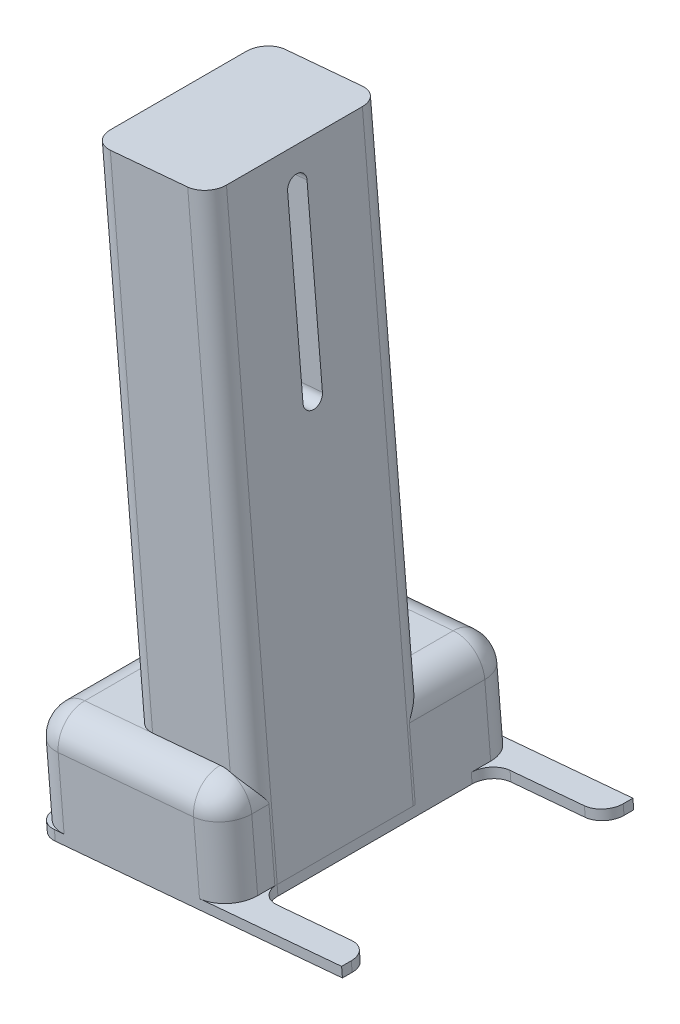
ISO-10303-21;
HEADER;
FILE_DESCRIPTION(('STEP AP214'),'2;1');
FILE_NAME('part.step','',(''),(''),'','','');
FILE_SCHEMA(('AUTOMOTIVE_DESIGN { 1 0 10303 214 1 1 1 1 }'));
ENDSEC;
DATA;
#1=APPLICATION_CONTEXT('core data for automotive mechanical design processes');
#2=APPLICATION_PROTOCOL_DEFINITION('international standard','automotive_design',2000,#1);
#3=PRODUCT_CONTEXT('',#1,'mechanical');
#4=PRODUCT('Part','Part','',(#3));
#5=PRODUCT_RELATED_PRODUCT_CATEGORY('part','',(#4));
#6=PRODUCT_DEFINITION_FORMATION('','',#4);
#7=PRODUCT_DEFINITION_CONTEXT('part definition',#1,'design');
#8=PRODUCT_DEFINITION('design','',#6,#7);
#9=PRODUCT_DEFINITION_SHAPE('','',#8);
#10=(LENGTH_UNIT() NAMED_UNIT(*) SI_UNIT(.MILLI.,.METRE.));
#11=(NAMED_UNIT(*) PLANE_ANGLE_UNIT() SI_UNIT($,.RADIAN.));
#12=(NAMED_UNIT(*) SI_UNIT($,.STERADIAN.) SOLID_ANGLE_UNIT());
#13=UNCERTAINTY_MEASURE_WITH_UNIT(LENGTH_MEASURE(1.E-05),#10,'distance_accuracy_value','');
#14=(GEOMETRIC_REPRESENTATION_CONTEXT(3) GLOBAL_UNCERTAINTY_ASSIGNED_CONTEXT((#13)) GLOBAL_UNIT_ASSIGNED_CONTEXT((#10,
#11,#12)) REPRESENTATION_CONTEXT('',''));
#15=CARTESIAN_POINT('',(0.,0.,0.));
#16=DIRECTION('',(0.,0.,1.));
#17=DIRECTION('',(1.,0.,0.));
#18=AXIS2_PLACEMENT_3D('',#15,#16,#17);
#19=CARTESIAN_POINT('',(-0.435778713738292,4.98097349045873,0.));
#20=DIRECTION('',(-0.996194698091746,-0.0871557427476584,0.));
#21=DIRECTION('',(0.0871557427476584,-0.996194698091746,0.));
#22=AXIS2_PLACEMENT_3D('',#19,#20,#21);
#23=PLANE('',#22);
#24=DIRECTION('',(0.0871557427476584,-0.996194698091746,0.));
#25=VECTOR('',#24,1.);
#26=CARTESIAN_POINT('',(-2.61467228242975,29.8858409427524,12.6139372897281));
#27=LINE('',#26,#25);
#28=CARTESIAN_POINT('',(-0.305045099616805,3.48668144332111,12.6139372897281));
#29=VERTEX_POINT('',#28);
#30=CARTESIAN_POINT('',(0.,0.,12.6139372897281));
#31=VERTEX_POINT('',#30);
#32=EDGE_CURVE('E494',#29,#31,#27,.T.);
#33=ORIENTED_EDGE('',*,*,#32,.F.);
#34=DIRECTION('',(0.,0.,-1.));
#35=VECTOR('',#34,1.);
#36=CARTESIAN_POINT('',(-0.305045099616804,3.48668144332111,0.));
#37=LINE('',#36,#35);
#38=CARTESIAN_POINT('',(-0.305045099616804,3.48668144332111,13.5));
#39=VERTEX_POINT('',#38);
#40=EDGE_CURVE('E564',#29,#39,#37,.F.);
#41=ORIENTED_EDGE('',*,*,#40,.T.);
#42=DIRECTION('',(0.0871557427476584,-0.996194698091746,0.));
#43=VECTOR('',#42,1.);
#44=CARTESIAN_POINT('',(-0.435778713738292,4.98097349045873,13.5));
#45=LINE('',#44,#43);
#46=CARTESIAN_POINT('',(0.,0.,13.5));
#47=VERTEX_POINT('',#46);
#48=EDGE_CURVE('E568',#39,#47,#45,.T.);
#49=ORIENTED_EDGE('',*,*,#48,.T.);
#50=DIRECTION('',(0.,0.,-1.));
#51=VECTOR('',#50,1.);
#52=CARTESIAN_POINT('',(0.,0.,0.));
#53=LINE('',#52,#51);
#54=EDGE_CURVE('E539',#47,#31,#53,.T.);
#55=ORIENTED_EDGE('',*,*,#54,.T.);
#56=EDGE_LOOP('',(#33,#41,#49,#55));
#57=FACE_BOUND('',#56,.T.);
#58=ADVANCED_FACE('F27',(#57),#23,.F.);
#59=DIRECTION('',(0.0871557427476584,-0.996194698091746,0.));
#60=VECTOR('',#59,1.);
#61=CARTESIAN_POINT('',(-2.61467228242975,29.8858409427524,5.3844195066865));
#62=LINE('',#61,#60);
#63=CARTESIAN_POINT('',(0.,0.,5.3844195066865));
#64=VERTEX_POINT('',#63);
#65=CARTESIAN_POINT('',(-0.305045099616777,3.48668144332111,5.38441950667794));
#66=VERTEX_POINT('',#65);
#67=EDGE_CURVE('E492',#64,#66,#62,.F.);
#68=ORIENTED_EDGE('',*,*,#67,.F.);
#69=DIRECTION('',(0.,0.,-1.));
#70=VECTOR('',#69,1.);
#71=CARTESIAN_POINT('',(0.,0.,2.5));
#72=LINE('',#71,#70);
#73=CARTESIAN_POINT('',(0.,0.,12.5));
#74=VERTEX_POINT('',#73);
#75=EDGE_CURVE('E345',#74,#64,#72,.T.);
#76=ORIENTED_EDGE('',*,*,#75,.F.);
#77=DIRECTION('',(-0.0871557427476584,0.996194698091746,0.));
#78=VECTOR('',#77,1.);
#79=CARTESIAN_POINT('',(0.0435778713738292,-0.498097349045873,12.5));
#80=LINE('',#79,#78);
#81=CARTESIAN_POINT('',(0.0435778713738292,-0.498097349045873,12.5));
#82=VERTEX_POINT('',#81);
#83=EDGE_CURVE('E420',#82,#74,#80,.T.);
#84=ORIENTED_EDGE('',*,*,#83,.F.);
#85=DIRECTION('',(0.,0.,-1.));
#86=VECTOR('',#85,1.);
#87=CARTESIAN_POINT('',(0.0435778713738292,-0.498097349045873,2.5));
#88=LINE('',#87,#86);
#89=CARTESIAN_POINT('',(0.0435778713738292,-0.498097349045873,2.5));
#90=VERTEX_POINT('',#89);
#91=EDGE_CURVE('E386',#82,#90,#88,.T.);
#92=ORIENTED_EDGE('',*,*,#91,.T.);
#93=DIRECTION('',(-0.0871557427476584,0.996194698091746,0.));
#94=VECTOR('',#93,1.);
#95=CARTESIAN_POINT('',(0.0435778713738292,-0.498097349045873,2.5));
#96=LINE('',#95,#94);
#97=CARTESIAN_POINT('',(0.,0.,2.5));
#98=VERTEX_POINT('',#97);
#99=EDGE_CURVE('E417',#90,#98,#96,.T.);
#100=ORIENTED_EDGE('',*,*,#99,.T.);
#101=DIRECTION('',(0.,0.,1.));
#102=VECTOR('',#101,1.);
#103=CARTESIAN_POINT('',(0.,0.,0.));
#104=LINE('',#103,#102);
#105=CARTESIAN_POINT('',(0.,0.,1.5));
#106=VERTEX_POINT('',#105);
#107=EDGE_CURVE('E408',#106,#98,#104,.T.);
#108=ORIENTED_EDGE('',*,*,#107,.F.);
#109=DIRECTION('',(0.0871557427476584,-0.996194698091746,0.));
#110=VECTOR('',#109,1.);
#111=CARTESIAN_POINT('',(-0.435778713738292,4.98097349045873,1.5));
#112=LINE('',#111,#110);
#113=CARTESIAN_POINT('',(-0.305045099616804,3.48668144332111,1.5));
#114=VERTEX_POINT('',#113);
#115=EDGE_CURVE('E571',#106,#114,#112,.F.);
#116=ORIENTED_EDGE('',*,*,#115,.T.);
#117=EDGE_CURVE('E565',#114,#66,#37,.F.);
#118=ORIENTED_EDGE('',*,*,#117,.T.);
#119=EDGE_LOOP('',(#68,#76,#84,#92,#100,#108,#116,#118));
#120=FACE_BOUND('',#119,.T.);
#121=ADVANCED_FACE('F649',(#120),#23,.F.);
#122=CARTESIAN_POINT('',(-0.435778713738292,4.98097349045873,15.));
#123=DIRECTION('',(0.0871557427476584,-0.996194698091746,0.));
#124=DIRECTION('',(0.996194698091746,0.0871557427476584,0.));
#125=AXIS2_PLACEMENT_3D('',#122,#123,#124);
#126=PLANE('',#125);
#127=DIRECTION('',(-0.996194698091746,-0.0871557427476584,0.));
#128=VECTOR('',#127,1.);
#129=CARTESIAN_POINT('',(-0.435778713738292,4.98097349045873,4.49917839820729));
#130=LINE('',#129,#128);
#131=CARTESIAN_POINT('',(-1.93007076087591,4.85023987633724,4.49917839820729));
#132=VERTEX_POINT('',#131);
#133=CARTESIAN_POINT('',(-5.4101707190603,4.54577058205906,4.49917839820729));
#134=VERTEX_POINT('',#133);
#135=EDGE_CURVE('E490',#132,#134,#130,.T.);
#136=ORIENTED_EDGE('',*,*,#135,.F.);
#137=DIRECTION('',(0.,0.,-1.));
#138=VECTOR('',#137,1.);
#139=CARTESIAN_POINT('',(-1.93007076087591,4.85023987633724,15.));
#140=LINE('',#139,#138);
#141=CARTESIAN_POINT('',(-1.93007076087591,4.85023987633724,1.5));
#142=VERTEX_POINT('',#141);
#143=EDGE_CURVE('E586',#132,#142,#140,.T.);
#144=ORIENTED_EDGE('',*,*,#143,.T.);
#145=DIRECTION('',(-0.996194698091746,-0.0871557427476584,0.));
#146=VECTOR('',#145,1.);
#147=CARTESIAN_POINT('',(-0.435778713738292,4.98097349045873,1.5));
#148=LINE('',#147,#146);
#149=CARTESIAN_POINT('',(-8.90343364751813,4.24014967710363,1.5));
#150=VERTEX_POINT('',#149);
#151=EDGE_CURVE('E580',#142,#150,#148,.T.);
#152=ORIENTED_EDGE('',*,*,#151,.T.);
#153=DIRECTION('',(0.,0.,1.));
#154=VECTOR('',#153,1.);
#155=CARTESIAN_POINT('',(-8.90343364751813,4.24014967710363,15.));
#156=LINE('',#155,#154);
#157=CARTESIAN_POINT('',(-8.90343364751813,4.24014967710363,13.5));
#158=VERTEX_POINT('',#157);
#159=EDGE_CURVE('E582',#150,#158,#156,.T.);
#160=ORIENTED_EDGE('',*,*,#159,.T.);
#161=DIRECTION('',(0.996194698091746,0.0871557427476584,0.));
#162=VECTOR('',#161,1.);
#163=CARTESIAN_POINT('',(-0.435778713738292,4.98097349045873,13.5));
#164=LINE('',#163,#162);
#165=CARTESIAN_POINT('',(-1.93007076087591,4.85023987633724,13.5));
#166=VERTEX_POINT('',#165);
#167=EDGE_CURVE('E584',#158,#166,#164,.T.);
#168=ORIENTED_EDGE('',*,*,#167,.T.);
#169=CARTESIAN_POINT('',(-1.93007076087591,4.85023987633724,13.4991783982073));
#170=VERTEX_POINT('',#169);
#171=EDGE_CURVE('E587',#166,#170,#140,.T.);
#172=ORIENTED_EDGE('',*,*,#171,.T.);
#173=DIRECTION('',(0.996194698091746,0.0871557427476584,0.));
#174=VECTOR('',#173,1.);
#175=CARTESIAN_POINT('',(-0.435778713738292,4.98097349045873,13.4991783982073));
#176=LINE('',#175,#174);
#177=CARTESIAN_POINT('',(-5.4101707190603,4.54577058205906,13.4991783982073));
#178=VERTEX_POINT('',#177);
#179=EDGE_CURVE('E488',#178,#170,#176,.T.);
#180=ORIENTED_EDGE('',*,*,#179,.F.);
#181=CARTESIAN_POINT('',(-5.4101707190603,4.54577058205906,12.4991783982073));
#182=DIRECTION('',(0.0871557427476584,-0.996194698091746,0.));
#183=DIRECTION('',(0.996194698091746,0.0871557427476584,0.));
#184=AXIS2_PLACEMENT_3D('',#181,#182,#183);
#185=CIRCLE('',#184,1.);
#186=CARTESIAN_POINT('',(-6.40636541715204,4.4586148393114,12.4991783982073));
#187=VERTEX_POINT('',#186);
#188=EDGE_CURVE('E497',#187,#178,#185,.F.);
#189=ORIENTED_EDGE('',*,*,#188,.F.);
#190=DIRECTION('',(0.,0.,1.));
#191=VECTOR('',#190,1.);
#192=CARTESIAN_POINT('',(-6.40636541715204,4.45861483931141,15.));
#193=LINE('',#192,#191);
#194=CARTESIAN_POINT('',(-6.40636541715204,4.4586148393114,5.49917839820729));
#195=VERTEX_POINT('',#194);
#196=EDGE_CURVE('E499',#195,#187,#193,.T.);
#197=ORIENTED_EDGE('',*,*,#196,.F.);
#198=CARTESIAN_POINT('',(-5.4101707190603,4.54577058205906,5.49917839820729));
#199=DIRECTION('',(0.0871557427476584,-0.996194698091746,0.));
#200=DIRECTION('',(0.996194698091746,0.0871557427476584,0.));
#201=AXIS2_PLACEMENT_3D('',#198,#199,#200);
#202=CIRCLE('',#201,0.999999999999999);
#203=EDGE_CURVE('E501',#134,#195,#202,.F.);
#204=ORIENTED_EDGE('',*,*,#203,.F.);
#205=EDGE_LOOP('',(#136,#144,#152,#160,#168,#172,#180,#189,#197,#204));
#206=FACE_BOUND('',#205,.T.);
#207=ADVANCED_FACE('F655',(#206),#126,.F.);
#208=CARTESIAN_POINT('',(-1.79933714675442,3.35594782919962,15.));
#209=DIRECTION('',(0.,0.,-1.));
#210=DIRECTION('',(-1.,0.,0.));
#211=AXIS2_PLACEMENT_3D('',#208,#209,#210);
#212=CYLINDRICAL_SURFACE('',#211,1.5);
#213=CARTESIAN_POINT('',(-1.79933714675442,3.35594782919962,4.49917839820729));
#214=DIRECTION('',(0.,0.,1.));
#215=DIRECTION('',(1.,0.,0.));
#216=AXIS2_PLACEMENT_3D('',#213,#214,#215);
#217=CIRCLE('',#216,1.5);
#218=CARTESIAN_POINT('',(-1.41771005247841,4.80658932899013,4.49917839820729));
#219=VERTEX_POINT('',#218);
#220=EDGE_CURVE('E38',#132,#219,#217,.F.);
#221=ORIENTED_EDGE('',*,*,#220,.T.);
#222=CARTESIAN_POINT('',(-0.305045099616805,3.48668144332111,5.61393728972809));
#223=CARTESIAN_POINT('',(-0.306150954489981,3.49931640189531,5.61394442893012));
#224=CARTESIAN_POINT('',(-0.307420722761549,3.51195374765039,5.61538150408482));
#225=CARTESIAN_POINT('',(-0.310219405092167,3.53674354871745,5.62061730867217));
#226=CARTESIAN_POINT('',(-0.311750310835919,3.54889131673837,5.62443483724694));
#227=CARTESIAN_POINT('',(-0.316187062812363,3.58109245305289,5.63674583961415));
#228=CARTESIAN_POINT('',(-0.31929041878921,3.60055403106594,5.64662814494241));
#229=CARTESIAN_POINT('',(-0.326052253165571,3.63843964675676,5.66809443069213));
#230=CARTESIAN_POINT('',(-0.329713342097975,3.65685821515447,5.67968640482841));
#231=CARTESIAN_POINT('',(-0.341613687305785,3.71154320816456,5.71580096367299));
#232=CARTESIAN_POINT('',(-0.350716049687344,3.74686796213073,5.74146127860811));
#233=CARTESIAN_POINT('',(-0.375409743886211,3.83028438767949,5.80375648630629));
#234=CARTESIAN_POINT('',(-0.392139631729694,3.8778181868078,5.84066773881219));
#235=CARTESIAN_POINT('',(-0.43044501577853,3.97132250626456,5.91413275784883));
#236=CARTESIAN_POINT('',(-0.452027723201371,4.01729058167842,5.95068590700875));
#237=CARTESIAN_POINT('',(-0.500054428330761,4.10724450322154,6.02234582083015));
#238=CARTESIAN_POINT('',(-0.526466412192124,4.15124115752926,6.05746034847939));
#239=CARTESIAN_POINT('',(-0.584419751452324,4.23723143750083,6.12577339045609));
#240=CARTESIAN_POINT('',(-0.615956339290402,4.2792268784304,6.15897364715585));
#241=CARTESIAN_POINT('',(-0.692706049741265,4.3707123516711,6.23048265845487));
#242=CARTESIAN_POINT('',(-0.739381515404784,4.41955287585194,6.26808010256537));
#243=CARTESIAN_POINT('',(-0.841373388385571,4.51225299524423,6.33735391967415));
#244=CARTESIAN_POINT('',(-0.896683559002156,4.55611614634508,6.3690345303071));
#245=CARTESIAN_POINT('',(-1.00319848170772,4.62849825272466,6.41812593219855));
#246=CARTESIAN_POINT('',(-1.05278457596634,4.65829826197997,6.43713820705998));
#247=CARTESIAN_POINT('',(-1.15678010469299,4.7126149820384,6.46835351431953));
#248=CARTESIAN_POINT('',(-1.21118300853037,4.73713869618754,6.48056560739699));
#249=CARTESIAN_POINT('',(-1.31428588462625,4.77624393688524,6.49517291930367));
#250=CARTESIAN_POINT('',(-1.36242906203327,4.79180072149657,6.49886324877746));
#251=CARTESIAN_POINT('',(-1.46009653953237,4.81795504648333,6.49945419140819));
#252=CARTESIAN_POINT('',(-1.509620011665,4.82855549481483,6.49635879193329));
#253=CARTESIAN_POINT('',(-1.60868177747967,4.84463080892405,6.48278223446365));
#254=CARTESIAN_POINT('',(-1.65821953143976,4.85008784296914,6.47227560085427));
#255=CARTESIAN_POINT('',(-1.75540075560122,4.85609487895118,6.44376111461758));
#256=CARTESIAN_POINT('',(-1.80304402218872,4.85664435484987,6.42575245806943));
#257=CARTESIAN_POINT('',(-1.89230283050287,4.85369428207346,6.38384348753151));
#258=CARTESIAN_POINT('',(-1.93410588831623,4.85041634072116,6.36032282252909));
#259=CARTESIAN_POINT('',(-2.01358289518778,4.84110830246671,6.30756721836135));
#260=CARTESIAN_POINT('',(-2.0512559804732,4.83507763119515,6.27833108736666));
#261=CARTESIAN_POINT('',(-2.12416948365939,4.820856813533,6.21266468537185));
#262=CARTESIAN_POINT('',(-2.15906484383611,4.81254675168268,6.17587810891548));
#263=CARTESIAN_POINT('',(-2.22271339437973,4.79533720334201,6.09743696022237));
#264=CARTESIAN_POINT('',(-2.2514630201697,4.78643737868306,6.05577958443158));
#265=CARTESIAN_POINT('',(-2.30479709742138,4.768526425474,5.96424548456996));
#266=CARTESIAN_POINT('',(-2.32871414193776,4.75958706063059,5.9139635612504));
#267=CARTESIAN_POINT('',(-2.36804590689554,4.74411942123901,5.80982868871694));
#268=CARTESIAN_POINT('',(-2.38346225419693,4.73759068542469,5.75597642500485));
#269=CARTESIAN_POINT('',(-2.40533806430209,4.72813867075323,5.64624935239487));
#270=CARTESIAN_POINT('',(-2.41181201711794,4.72520956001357,5.59037796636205));
#271=CARTESIAN_POINT('',(-2.41561837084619,4.72350148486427,5.47827076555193));
#272=CARTESIAN_POINT('',(-2.4129533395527,4.72472135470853,5.42203505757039));
#273=CARTESIAN_POINT('',(-2.39893963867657,4.73091280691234,5.31368798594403));
#274=CARTESIAN_POINT('',(-2.38802071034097,4.73569855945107,5.26150922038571));
#275=CARTESIAN_POINT('',(-2.35832267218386,4.74799356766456,5.15977238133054));
#276=CARTESIAN_POINT('',(-2.33954092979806,4.75550373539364,5.11021519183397));
#277=CARTESIAN_POINT('',(-2.29380199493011,4.77232184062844,5.01331122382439));
#278=CARTESIAN_POINT('',(-2.26659626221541,4.78168077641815,4.96609072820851));
#279=CARTESIAN_POINT('',(-2.20477443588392,4.80047636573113,4.87676811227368));
#280=CARTESIAN_POINT('',(-2.17015586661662,4.80991304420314,4.83466770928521));
#281=CARTESIAN_POINT('',(-2.09291129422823,4.82748830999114,4.75538878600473));
#282=CARTESIAN_POINT('',(-2.05006068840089,4.83557443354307,4.71841593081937));
#283=CARTESIAN_POINT('',(-1.95823055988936,4.84822532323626,4.65231436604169));
#284=CARTESIAN_POINT('',(-1.90925646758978,4.85279318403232,4.62317877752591));
#285=CARTESIAN_POINT('',(-1.810919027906,4.85664387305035,4.57576338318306));
#286=CARTESIAN_POINT('',(-1.76190097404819,4.85632066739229,4.556801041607));
#287=CARTESIAN_POINT('',(-1.66179336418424,4.85046764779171,4.52686044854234));
#288=CARTESIAN_POINT('',(-1.610704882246,4.84494050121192,4.51587811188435));
#289=CARTESIAN_POINT('',(-1.51259110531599,4.82905455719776,4.50238128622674));
#290=CARTESIAN_POINT('',(-1.46557782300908,4.81913133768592,4.49924370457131));
#291=CARTESIAN_POINT('',(-1.37273244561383,4.79480611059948,4.49911506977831));
#292=CARTESIAN_POINT('',(-1.32690058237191,4.78040323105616,4.50212521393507));
#293=CARTESIAN_POINT('',(-1.23499315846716,4.74664659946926,4.51386127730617));
#294=CARTESIAN_POINT('',(-1.1890415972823,4.72706499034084,4.52289106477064));
#295=CARTESIAN_POINT('',(-1.10034259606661,4.68404526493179,4.54596859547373));
#296=CARTESIAN_POINT('',(-1.05759683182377,4.66060515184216,4.56001894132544));
#297=CARTESIAN_POINT('',(-0.953323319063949,4.59681975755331,4.60098690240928));
#298=CARTESIAN_POINT('',(-0.894275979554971,4.55422969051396,4.6307421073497));
#299=CARTESIAN_POINT('',(-0.78505073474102,4.46333398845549,4.69714236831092));
#300=CARTESIAN_POINT('',(-0.734899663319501,4.41501177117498,4.73380760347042));
#301=CARTESIAN_POINT('',(-0.624941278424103,4.29397356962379,4.82746886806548));
#302=CARTESIAN_POINT('',(-0.569303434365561,4.21923528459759,4.88672847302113));
#303=CARTESIAN_POINT('',(-0.474008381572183,4.0643227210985,5.01022556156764));
#304=CARTESIAN_POINT('',(-0.434329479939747,3.98415599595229,5.07445614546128));
#305=CARTESIAN_POINT('',(-0.390915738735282,3.8729416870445,5.16135004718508));
#306=CARTESIAN_POINT('',(-0.380647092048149,3.84406683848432,5.1837197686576));
#307=CARTESIAN_POINT('',(-0.361820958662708,3.7854812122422,5.22823927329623));
#308=CARTESIAN_POINT('',(-0.35326644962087,3.75576908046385,5.25038861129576));
#309=CARTESIAN_POINT('',(-0.339080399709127,3.69995803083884,5.29008849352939));
#310=CARTESIAN_POINT('',(-0.333200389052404,3.67403531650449,5.30781047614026));
#311=CARTESIAN_POINT('',(-0.322595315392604,3.62049707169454,5.34116598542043));
#312=CARTESIAN_POINT('',(-0.317867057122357,3.59288649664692,5.35680523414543));
#313=CARTESIAN_POINT('',(-0.311979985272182,3.55070384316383,5.3733334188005));
#314=CARTESIAN_POINT('',(-0.310318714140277,3.53762902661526,5.37755570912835));
#315=CARTESIAN_POINT('',(-0.307309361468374,3.51096162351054,5.3831817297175));
#316=CARTESIAN_POINT('',(-0.305957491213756,3.49737797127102,5.38462136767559));
#317=CARTESIAN_POINT('',(-0.303628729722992,3.47015904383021,5.38416833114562));
#318=CARTESIAN_POINT('',(-0.30265417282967,3.45652395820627,5.3822553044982));
#319=CARTESIAN_POINT('',(-0.301091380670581,3.42973320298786,5.37583452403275));
#320=CARTESIAN_POINT('',(-0.300508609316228,3.41658663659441,5.37129165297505));
#321=CARTESIAN_POINT('',(-0.299529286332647,3.38589420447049,5.3586499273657));
#322=CARTESIAN_POINT('',(-0.299295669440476,3.3686475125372,5.34985520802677));
#323=CARTESIAN_POINT('',(-0.299390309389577,3.33487519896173,5.33095074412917));
#324=CARTESIAN_POINT('',(-0.299720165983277,3.31835176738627,5.32083733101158));
#325=CARTESIAN_POINT('',(-0.301481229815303,3.26932937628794,5.28950122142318));
#326=CARTESIAN_POINT('',(-0.303686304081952,3.237470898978,5.26733213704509));
#327=CARTESIAN_POINT('',(-0.312006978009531,3.15472038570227,5.20835382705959));
#328=CARTESIAN_POINT('',(-0.319704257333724,3.10435839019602,5.17104255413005));
#329=CARTESIAN_POINT('',(-0.340230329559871,3.00437152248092,5.09670048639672));
#330=CARTESIAN_POINT('',(-0.353065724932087,2.95474768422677,5.05967011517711));
#331=CARTESIAN_POINT('',(-0.384007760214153,2.85645888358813,4.9868853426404));
#332=CARTESIAN_POINT('',(-0.402097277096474,2.80779134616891,4.95112721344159));
#333=CARTESIAN_POINT('',(-0.443801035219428,2.71153381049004,4.88151380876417));
#334=CARTESIAN_POINT('',(-0.467410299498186,2.66394288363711,4.84765685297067));
#335=CARTESIAN_POINT('',(-0.526235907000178,2.5600125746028,4.77550780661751));
#336=CARTESIAN_POINT('',(-0.562859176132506,2.50401514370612,4.73784702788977));
#337=CARTESIAN_POINT('',(-0.6452989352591,2.39530433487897,4.66823351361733));
#338=CARTESIAN_POINT('',(-0.691105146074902,2.34258737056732,4.63627447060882));
#339=CARTESIAN_POINT('',(-0.782299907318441,2.25189856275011,4.58590576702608));
#340=CARTESIAN_POINT('',(-0.826023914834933,2.21305738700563,4.56606895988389));
#341=CARTESIAN_POINT('',(-0.919351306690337,2.13975315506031,4.53325200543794));
#342=CARTESIAN_POINT('',(-0.968947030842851,2.1052845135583,4.5202630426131));
#343=CARTESIAN_POINT('',(-1.0639958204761,2.0475885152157,4.50441101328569));
#344=CARTESIAN_POINT('',(-1.10866268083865,2.02344906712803,4.50017696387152));
#345=CARTESIAN_POINT('',(-1.20034011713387,1.97980349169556,4.4984945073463));
#346=CARTESIAN_POINT('',(-1.24734924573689,1.96029454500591,4.50104195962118));
#347=CARTESIAN_POINT('',(-1.34242028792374,1.92633807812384,4.51355880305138));
#348=CARTESIAN_POINT('',(-1.39048547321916,1.91190970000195,4.52355583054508));
#349=CARTESIAN_POINT('',(-1.48572031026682,1.88827868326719,4.55113260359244));
#350=CARTESIAN_POINT('',(-1.53288989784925,1.87907641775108,4.56871289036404));
#351=CARTESIAN_POINT('',(-1.62184742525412,1.86584653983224,4.60979543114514));
#352=CARTESIAN_POINT('',(-1.66378854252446,1.86154295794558,4.63288180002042));
#353=CARTESIAN_POINT('',(-1.74415761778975,1.856421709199,4.6848142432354));
#354=CARTESIAN_POINT('',(-1.78258486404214,1.85560474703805,4.71366148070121));
#355=CARTESIAN_POINT('',(-1.85736755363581,1.85657394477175,4.7784612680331));
#356=CARTESIAN_POINT('',(-1.89342494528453,1.85853315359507,4.81475427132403));
#357=CARTESIAN_POINT('',(-1.95968717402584,1.86417174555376,4.89223282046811));
#358=CARTESIAN_POINT('',(-1.98988863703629,1.86785211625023,4.93342116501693));
#359=CARTESIAN_POINT('',(-2.04638357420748,1.87612919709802,5.02407724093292));
#360=CARTESIAN_POINT('',(-2.07200545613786,1.88078033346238,5.0739607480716));
#361=CARTESIAN_POINT('',(-2.1145471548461,1.88927931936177,5.17737632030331));
#362=CARTESIAN_POINT('',(-2.13146828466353,1.89312729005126,5.23090783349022));
#363=CARTESIAN_POINT('',(-2.1559886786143,1.8989090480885,5.34031753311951));
#364=CARTESIAN_POINT('',(-2.163565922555,1.90083831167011,5.39620094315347));
#365=CARTESIAN_POINT('',(-2.16896803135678,1.90220018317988,5.50845773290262));
#366=CARTESIAN_POINT('',(-2.1667959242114,1.90163356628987,5.56483095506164));
#367=CARTESIAN_POINT('',(-2.15316646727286,1.89826208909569,5.67348896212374));
#368=CARTESIAN_POINT('',(-2.14217831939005,1.89557043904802,5.72583731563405));
#369=CARTESIAN_POINT('',(-2.11193910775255,1.88880164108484,5.8279989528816));
#370=CARTESIAN_POINT('',(-2.09268534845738,1.88472404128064,5.87781140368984));
#371=CARTESIAN_POINT('',(-2.04584068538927,1.87614459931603,5.9751683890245));
#372=CARTESIAN_POINT('',(-2.0180166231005,1.87163369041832,6.02259978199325));
#373=CARTESIAN_POINT('',(-1.9550304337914,1.86371278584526,6.11244112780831));
#374=CARTESIAN_POINT('',(-1.91986572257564,1.86030317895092,6.15484930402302));
#375=CARTESIAN_POINT('',(-1.84173387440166,1.8560195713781,6.23497585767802));
#376=CARTESIAN_POINT('',(-1.7985335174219,1.8552401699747,6.27247350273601));
#377=CARTESIAN_POINT('',(-1.70658962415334,1.85811447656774,6.33969645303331));
#378=CARTESIAN_POINT('',(-1.65785078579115,1.86176445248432,6.36942827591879));
#379=CARTESIAN_POINT('',(-1.56057431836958,1.87432440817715,6.41811682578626));
#380=CARTESIAN_POINT('',(-1.51230930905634,1.88280841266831,6.43772622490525));
#381=CARTESIAN_POINT('',(-1.41449723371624,1.90528941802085,6.46890855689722));
#382=CARTESIAN_POINT('',(-1.36495089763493,1.91928334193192,6.48048596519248));
#383=CARTESIAN_POINT('',(-1.27074827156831,1.95136299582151,6.49501410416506));
#384=CARTESIAN_POINT('',(-1.22603549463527,1.96899763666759,6.49861669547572));
#385=CARTESIAN_POINT('',(-1.13847405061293,2.0085174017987,6.49961841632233));
#386=CARTESIAN_POINT('',(-1.09562573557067,2.03040332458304,6.49701637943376));
#387=CARTESIAN_POINT('',(-1.01071962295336,2.07900122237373,6.48607865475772));
#388=CARTESIAN_POINT('',(-0.968804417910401,2.10589764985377,6.4774671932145));
#389=CARTESIAN_POINT('',(-0.888734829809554,2.16295712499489,6.45520051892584));
#390=CARTESIAN_POINT('',(-0.850582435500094,2.19312188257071,6.44154265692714));
#391=CARTESIAN_POINT('',(-0.758873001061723,2.27296256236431,6.40165535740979));
#392=CARTESIAN_POINT('',(-0.708067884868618,2.32440617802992,6.37261532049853));
#393=CARTESIAN_POINT('',(-0.616035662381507,2.43138926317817,6.30764726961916));
#394=CARTESIAN_POINT('',(-0.574835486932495,2.48693968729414,6.27170039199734));
#395=CARTESIAN_POINT('',(-0.486913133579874,2.6234754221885,6.17969137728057));
#396=CARTESIAN_POINT('',(-0.444571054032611,2.70574878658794,6.12133365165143));
#397=CARTESIAN_POINT('',(-0.393418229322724,2.83113386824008,6.03009357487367));
#398=CARTESIAN_POINT('',(-0.378425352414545,2.87326778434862,5.99905555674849));
#399=CARTESIAN_POINT('',(-0.352367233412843,2.958142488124,5.93613348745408));
#400=CARTESIAN_POINT('',(-0.34130195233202,3.00088326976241,5.9042494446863));
#401=CARTESIAN_POINT('',(-0.324883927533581,3.07808697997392,5.84684540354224));
#402=CARTESIAN_POINT('',(-0.318823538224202,3.11243790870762,5.82136997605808));
#403=CARTESIAN_POINT('',(-0.309082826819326,3.18168040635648,5.77071876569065));
#404=CARTESIAN_POINT('',(-0.305400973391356,3.21657161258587,5.74554280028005));
#405=CARTESIAN_POINT('',(-0.301559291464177,3.2719486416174,5.7075502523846));
#406=CARTESIAN_POINT('',(-0.30056228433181,3.2920005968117,5.69418000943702));
#407=CARTESIAN_POINT('',(-0.299373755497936,3.33289567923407,5.66853132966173));
#408=CARTESIAN_POINT('',(-0.299183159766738,3.35373968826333,5.65625416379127));
#409=CARTESIAN_POINT('',(-0.299623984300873,3.38782644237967,5.63913816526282));
#410=CARTESIAN_POINT('',(-0.299943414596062,3.40057937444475,5.63334251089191));
#411=CARTESIAN_POINT('',(-0.300952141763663,3.42674011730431,5.62356181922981));
#412=CARTESIAN_POINT('',(-0.301639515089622,3.4401441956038,5.61956756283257));
#413=CARTESIAN_POINT('',(-0.302887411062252,3.45923313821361,5.61602445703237));
#414=CARTESIAN_POINT('',(-0.303274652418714,3.46470080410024,5.61524728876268));
#415=CARTESIAN_POINT('',(-0.304112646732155,3.47567268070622,5.61420247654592));
#416=CARTESIAN_POINT('',(-0.304563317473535,3.48117683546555,5.61393417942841));
#417=CARTESIAN_POINT('',(-0.305045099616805,3.48668144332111,5.61393728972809));
#418=B_SPLINE_CURVE_WITH_KNOTS('',3,(#222,#223,#224,#225,#226,#227,#228,#229,#230,#231,#232,
#233,#234,#235,#236,#237,#238,#239,#240,#241,#242,#243,#244,#245,#246,#247,#248,#249,#250,#251,
#252,#253,#254,#255,#256,#257,#258,#259,#260,#261,#262,#263,#264,#265,#266,#267,#268,#269,#270,
#271,#272,#273,#274,#275,#276,#277,#278,#279,#280,#281,#282,#283,#284,#285,#286,#287,#288,#289,
#290,#291,#292,#293,#294,#295,#296,#297,#298,#299,#300,#301,#302,#303,#304,#305,#306,#307,#308,
#309,#310,#311,#312,#313,#314,#315,#316,#317,#318,#319,#320,#321,#322,#323,#324,#325,#326,#327,
#328,#329,#330,#331,#332,#333,#334,#335,#336,#337,#338,#339,#340,#341,#342,#343,#344,#345,#346,
#347,#348,#349,#350,#351,#352,#353,#354,#355,#356,#357,#358,#359,#360,#361,#362,#363,#364,#365,
#366,#367,#368,#369,#370,#371,#372,#373,#374,#375,#376,#377,#378,#379,#380,#381,#382,#383,#384,
#385,#386,#387,#388,#389,#390,#391,#392,#393,#394,#395,#396,#397,#398,#399,#400,#401,#402,#403,
#404,#405,#406,#407,#408,#409,#410,#411,#412,#413,#414,#415,#416,#417),.UNSPECIFIED.,.T.,.F.,(4,
2,2,2,2,2,2,2,2,2,2,2,2,2,2,2,2,2,2,2,2,2,2,2,2,2,2,2,2,2,2,2,2,2,2,2,2,2,2,2,2,2,2,2,2,2,2,2,2,
2,2,2,2,2,2,2,2,2,2,2,2,2,2,2,2,2,2,2,2,2,2,2,2,2,2,2,2,2,2,2,2,2,2,2,2,2,2,2,2,2,2,2,2,2,2,2,2,
4),(0.,0.0380226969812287,0.0763495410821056,0.142217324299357,0.20840346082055,
0.342045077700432,0.52925250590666,0.716739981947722,0.903026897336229,1.08914148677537,
1.32035055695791,1.55139339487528,1.733417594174,1.91519867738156,2.06674014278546,
2.21819258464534,2.37016818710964,2.52216007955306,2.66577057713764,2.80941105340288,
2.96292205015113,3.11652184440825,3.28490832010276,3.4532625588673,3.62134367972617,
3.78937757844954,3.94921831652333,4.10911261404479,4.27426507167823,4.4394727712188,
4.61007634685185,4.78052968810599,4.93733187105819,5.09405372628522,5.2378638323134,
5.38170194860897,5.53341393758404,5.68520468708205,5.91983059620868,6.15515260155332,
6.48466359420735,6.81372515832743,6.92753287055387,7.04153659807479,7.13742248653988,
7.23303925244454,7.2743702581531,7.31516426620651,7.3562067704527,7.39781040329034,
7.45574759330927,7.51384954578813,7.63036690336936,7.81960264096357,8.00908233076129,
8.19795131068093,8.38665064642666,8.616287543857,8.84566881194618,9.0302654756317,
9.21462391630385,9.36682726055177,9.51893769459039,9.67161525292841,9.82430370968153,
9.96788264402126,10.1114905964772,10.2644539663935,10.4175052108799,10.5855329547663,
10.7535353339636,10.9219328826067,11.0902781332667,11.2502148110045,11.4102036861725,
11.5750005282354,11.7398554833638,11.9105798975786,12.0811605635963,12.2386266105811,
12.3960048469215,12.5399529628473,12.6839281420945,12.8349862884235,12.9861238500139,
13.218553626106,13.4516274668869,13.777904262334,13.9411162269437,14.1043265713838,
14.2338546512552,14.3632992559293,14.4356511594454,14.5080861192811,14.5500585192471,
14.5918136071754,14.6084000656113,14.6249652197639),.UNSPECIFIED.);
#419=EDGE_CURVE('E11',#219,#66,#418,.T.);
#420=ORIENTED_EDGE('',*,*,#419,.T.);
#421=ORIENTED_EDGE('',*,*,#117,.F.);
#422=CARTESIAN_POINT('',(-1.79933714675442,3.35594782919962,1.5));
#423=DIRECTION('',(0.,0.,-1.));
#424=DIRECTION('',(-1.,0.,0.));
#425=AXIS2_PLACEMENT_3D('',#422,#423,#424);
#426=CIRCLE('',#425,1.5);
#427=EDGE_CURVE('E524',#142,#114,#426,.T.);
#428=ORIENTED_EDGE('',*,*,#427,.F.);
#429=ORIENTED_EDGE('',*,*,#143,.F.);
#430=EDGE_LOOP('',(#221,#420,#421,#428,#429));
#431=FACE_BOUND('',#430,.T.);
#432=ADVANCED_FACE('F598',(#431),#212,.T.);
#433=ORIENTED_EDGE('',*,*,#40,.F.);
#434=CARTESIAN_POINT('',(-0.305045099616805,3.48668144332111,12.6139372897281));
#435=CARTESIAN_POINT('',(-0.306150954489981,3.49931640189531,12.6139444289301));
#436=CARTESIAN_POINT('',(-0.307420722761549,3.51195374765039,12.6153815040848));
#437=CARTESIAN_POINT('',(-0.310219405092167,3.53674354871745,12.6206173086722));
#438=CARTESIAN_POINT('',(-0.311750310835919,3.54889131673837,12.6244348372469));
#439=CARTESIAN_POINT('',(-0.316187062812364,3.5810924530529,12.6367458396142));
#440=CARTESIAN_POINT('',(-0.319290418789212,3.60055403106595,12.6466281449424));
#441=CARTESIAN_POINT('',(-0.326052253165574,3.63843964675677,12.6680944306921));
#442=CARTESIAN_POINT('',(-0.329713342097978,3.65685821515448,12.6796864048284));
#443=CARTESIAN_POINT('',(-0.341613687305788,3.71154320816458,12.715800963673));
#444=CARTESIAN_POINT('',(-0.350716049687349,3.74686796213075,12.7414612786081));
#445=CARTESIAN_POINT('',(-0.375409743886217,3.8302843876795,12.8037564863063));
#446=CARTESIAN_POINT('',(-0.392139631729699,3.87781818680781,12.8406677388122));
#447=CARTESIAN_POINT('',(-0.430445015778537,3.97132250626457,12.9141327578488));
#448=CARTESIAN_POINT('',(-0.452027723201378,4.01729058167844,12.9506859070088));
#449=CARTESIAN_POINT('',(-0.500054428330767,4.10724450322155,13.0223458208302));
#450=CARTESIAN_POINT('',(-0.526466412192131,4.15124115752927,13.0574603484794));
#451=CARTESIAN_POINT('',(-0.584419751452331,4.23723143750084,13.1257733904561));
#452=CARTESIAN_POINT('',(-0.615956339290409,4.27922687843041,13.1589736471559));
#453=CARTESIAN_POINT('',(-0.692706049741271,4.37071235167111,13.2304826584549));
#454=CARTESIAN_POINT('',(-0.73938151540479,4.41955287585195,13.2680801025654));
#455=CARTESIAN_POINT('',(-0.841373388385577,4.51225299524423,13.3373539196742));
#456=CARTESIAN_POINT('',(-0.896683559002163,4.55611614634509,13.3690345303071));
#457=CARTESIAN_POINT('',(-1.00319848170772,4.62849825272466,13.4181259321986));
#458=CARTESIAN_POINT('',(-1.05278457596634,4.65829826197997,13.43713820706));
#459=CARTESIAN_POINT('',(-1.15678010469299,4.71261498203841,13.4683535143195));
#460=CARTESIAN_POINT('',(-1.21118300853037,4.73713869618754,13.480565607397));
#461=CARTESIAN_POINT('',(-1.31428588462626,4.77624393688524,13.4951729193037));
#462=CARTESIAN_POINT('',(-1.36242906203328,4.79180072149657,13.4988632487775));
#463=CARTESIAN_POINT('',(-1.46009653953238,4.81795504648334,13.4994541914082));
#464=CARTESIAN_POINT('',(-1.50962001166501,4.82855549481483,13.4963587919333));
#465=CARTESIAN_POINT('',(-1.60868177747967,4.84463080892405,13.4827822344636));
#466=CARTESIAN_POINT('',(-1.65821953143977,4.85008784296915,13.4722756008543));
#467=CARTESIAN_POINT('',(-1.75540075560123,4.85609487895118,13.4437611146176));
#468=CARTESIAN_POINT('',(-1.80304402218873,4.85664435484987,13.4257524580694));
#469=CARTESIAN_POINT('',(-1.89230283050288,4.85369428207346,13.3838434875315));
#470=CARTESIAN_POINT('',(-1.93410588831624,4.85041634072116,13.3603228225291));
#471=CARTESIAN_POINT('',(-2.01358289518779,4.84110830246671,13.3075672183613));
#472=CARTESIAN_POINT('',(-2.0512559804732,4.83507763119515,13.2783310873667));
#473=CARTESIAN_POINT('',(-2.12416948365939,4.820856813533,13.2126646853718));
#474=CARTESIAN_POINT('',(-2.15906484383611,4.81254675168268,13.1758781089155));
#475=CARTESIAN_POINT('',(-2.22271339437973,4.79533720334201,13.0974369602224));
#476=CARTESIAN_POINT('',(-2.25146302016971,4.78643737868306,13.0557795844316));
#477=CARTESIAN_POINT('',(-2.30479709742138,4.768526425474,12.96424548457));
#478=CARTESIAN_POINT('',(-2.32871414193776,4.75958706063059,12.9139635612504));
#479=CARTESIAN_POINT('',(-2.36804590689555,4.744119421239,12.8098286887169));
#480=CARTESIAN_POINT('',(-2.38346225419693,4.73759068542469,12.7559764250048));
#481=CARTESIAN_POINT('',(-2.40533806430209,4.72813867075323,12.6462493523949));
#482=CARTESIAN_POINT('',(-2.41181201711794,4.72520956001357,12.590377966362));
#483=CARTESIAN_POINT('',(-2.41561837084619,4.72350148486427,12.4782707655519));
#484=CARTESIAN_POINT('',(-2.4129533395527,4.72472135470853,12.4220350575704));
#485=CARTESIAN_POINT('',(-2.39893963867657,4.73091280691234,12.313687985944));
#486=CARTESIAN_POINT('',(-2.38802071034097,4.73569855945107,12.2615092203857));
#487=CARTESIAN_POINT('',(-2.35832267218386,4.74799356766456,12.1597723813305));
#488=CARTESIAN_POINT('',(-2.33954092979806,4.75550373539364,12.110215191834));
#489=CARTESIAN_POINT('',(-2.29380199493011,4.77232184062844,12.0133112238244));
#490=CARTESIAN_POINT('',(-2.26659626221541,4.78168077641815,11.9660907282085));
#491=CARTESIAN_POINT('',(-2.20477443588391,4.80047636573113,11.8767681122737));
#492=CARTESIAN_POINT('',(-2.17015586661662,4.80991304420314,11.8346677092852));
#493=CARTESIAN_POINT('',(-2.09291129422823,4.82748830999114,11.7553887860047));
#494=CARTESIAN_POINT('',(-2.05006068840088,4.83557443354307,11.7184159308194));
#495=CARTESIAN_POINT('',(-1.95823055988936,4.84822532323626,11.6523143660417));
#496=CARTESIAN_POINT('',(-1.90925646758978,4.85279318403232,11.6231787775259));
#497=CARTESIAN_POINT('',(-1.810919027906,4.85664387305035,11.5757633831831));
#498=CARTESIAN_POINT('',(-1.76190097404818,4.85632066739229,11.556801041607));
#499=CARTESIAN_POINT('',(-1.66179336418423,4.85046764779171,11.5268604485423));
#500=CARTESIAN_POINT('',(-1.61070488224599,4.84494050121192,11.5158781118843));
#501=CARTESIAN_POINT('',(-1.51259110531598,4.82905455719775,11.5023812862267));
#502=CARTESIAN_POINT('',(-1.46557782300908,4.81913133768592,11.4992437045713));
#503=CARTESIAN_POINT('',(-1.37273244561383,4.79480611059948,11.4991150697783));
#504=CARTESIAN_POINT('',(-1.3269005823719,4.78040323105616,11.5021252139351));
#505=CARTESIAN_POINT('',(-1.23499315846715,4.74664659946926,11.5138612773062));
#506=CARTESIAN_POINT('',(-1.1890415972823,4.72706499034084,11.5228910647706));
#507=CARTESIAN_POINT('',(-1.1003425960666,4.68404526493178,11.5459685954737));
#508=CARTESIAN_POINT('',(-1.05759683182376,4.66060515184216,11.5600189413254));
#509=CARTESIAN_POINT('',(-0.953323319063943,4.59681975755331,11.6009869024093));
#510=CARTESIAN_POINT('',(-0.894275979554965,4.55422969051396,11.6307421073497));
#511=CARTESIAN_POINT('',(-0.785050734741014,4.46333398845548,11.6971423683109));
#512=CARTESIAN_POINT('',(-0.734899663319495,4.41501177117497,11.7338076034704));
#513=CARTESIAN_POINT('',(-0.624941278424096,4.29397356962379,11.8274688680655));
#514=CARTESIAN_POINT('',(-0.569303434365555,4.21923528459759,11.8867284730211));
#515=CARTESIAN_POINT('',(-0.474008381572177,4.06432272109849,12.0102255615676));
#516=CARTESIAN_POINT('',(-0.434329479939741,3.98415599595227,12.0744561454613));
#517=CARTESIAN_POINT('',(-0.390915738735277,3.87294168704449,12.1613500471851));
#518=CARTESIAN_POINT('',(-0.380647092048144,3.8440668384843,12.1837197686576));
#519=CARTESIAN_POINT('',(-0.361820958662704,3.78548121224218,12.2282392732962));
#520=CARTESIAN_POINT('',(-0.353266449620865,3.75576908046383,12.2503886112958));
#521=CARTESIAN_POINT('',(-0.339080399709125,3.69995803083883,12.2900884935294));
#522=CARTESIAN_POINT('',(-0.333200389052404,3.67403531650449,12.3078104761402));
#523=CARTESIAN_POINT('',(-0.322595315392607,3.62049707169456,12.3411659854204));
#524=CARTESIAN_POINT('',(-0.317867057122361,3.59288649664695,12.3568052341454));
#525=CARTESIAN_POINT('',(-0.311979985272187,3.55070384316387,12.3733334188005));
#526=CARTESIAN_POINT('',(-0.310318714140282,3.53762902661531,12.3775557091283));
#527=CARTESIAN_POINT('',(-0.30730936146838,3.51096162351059,12.3831817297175));
#528=CARTESIAN_POINT('',(-0.305957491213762,3.49737797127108,12.3846213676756));
#529=CARTESIAN_POINT('',(-0.303628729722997,3.47015904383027,12.3841683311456));
#530=CARTESIAN_POINT('',(-0.302654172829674,3.45652395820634,12.3822553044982));
#531=CARTESIAN_POINT('',(-0.301091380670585,3.42973320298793,12.3758345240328));
#532=CARTESIAN_POINT('',(-0.30050860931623,3.41658663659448,12.3712916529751));
#533=CARTESIAN_POINT('',(-0.299529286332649,3.38589420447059,12.3586499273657));
#534=CARTESIAN_POINT('',(-0.299295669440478,3.36864751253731,12.3498552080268));
#535=CARTESIAN_POINT('',(-0.299390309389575,3.33487519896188,12.3309507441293));
#536=CARTESIAN_POINT('',(-0.299720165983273,3.31835176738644,12.3208373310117));
#537=CARTESIAN_POINT('',(-0.301481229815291,3.26932937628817,12.2895012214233));
#538=CARTESIAN_POINT('',(-0.303686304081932,3.23747089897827,12.2673321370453));
#539=CARTESIAN_POINT('',(-0.31200697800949,3.15472038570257,12.2083538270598));
#540=CARTESIAN_POINT('',(-0.319704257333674,3.10435839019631,12.1710425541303));
#541=CARTESIAN_POINT('',(-0.340230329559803,3.0043715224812,12.0967004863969));
#542=CARTESIAN_POINT('',(-0.353065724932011,2.95474768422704,12.0596701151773));
#543=CARTESIAN_POINT('',(-0.384007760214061,2.85645888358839,11.9868853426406));
#544=CARTESIAN_POINT('',(-0.402097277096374,2.80779134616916,11.9511272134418));
#545=CARTESIAN_POINT('',(-0.443801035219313,2.71153381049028,11.8815138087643));
#546=CARTESIAN_POINT('',(-0.467410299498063,2.66394288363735,11.8476568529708));
#547=CARTESIAN_POINT('',(-0.526235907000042,2.56001257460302,11.7755078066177));
#548=CARTESIAN_POINT('',(-0.562859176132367,2.50401514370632,11.7378470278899));
#549=CARTESIAN_POINT('',(-0.645298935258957,2.39530433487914,11.6682335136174));
#550=CARTESIAN_POINT('',(-0.691105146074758,2.34258737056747,11.6362744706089));
#551=CARTESIAN_POINT('',(-0.782299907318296,2.25189856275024,11.5859057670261));
#552=CARTESIAN_POINT('',(-0.826023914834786,2.21305738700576,11.566068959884));
#553=CARTESIAN_POINT('',(-0.919351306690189,2.13975315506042,11.533252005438));
#554=CARTESIAN_POINT('',(-0.968947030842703,2.10528451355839,11.5202630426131));
#555=CARTESIAN_POINT('',(-1.06399582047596,2.04758851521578,11.5044110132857));
#556=CARTESIAN_POINT('',(-1.1086626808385,2.0234490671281,11.5001769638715));
#557=CARTESIAN_POINT('',(-1.20034011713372,1.97980349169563,11.4984945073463));
#558=CARTESIAN_POINT('',(-1.24734924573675,1.96029454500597,11.5010419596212));
#559=CARTESIAN_POINT('',(-1.34242028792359,1.92633807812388,11.5135588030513));
#560=CARTESIAN_POINT('',(-1.39048547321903,1.91190970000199,11.523555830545));
#561=CARTESIAN_POINT('',(-1.48572031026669,1.88827868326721,11.5511326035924));
#562=CARTESIAN_POINT('',(-1.53288989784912,1.8790764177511,11.568712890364));
#563=CARTESIAN_POINT('',(-1.621847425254,1.86584653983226,11.6097954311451));
#564=CARTESIAN_POINT('',(-1.66378854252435,1.86154295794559,11.6328818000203));
#565=CARTESIAN_POINT('',(-1.74415761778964,1.856421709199,11.6848142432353));
#566=CARTESIAN_POINT('',(-1.78258486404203,1.85560474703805,11.7136614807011));
#567=CARTESIAN_POINT('',(-1.85736755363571,1.85657394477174,11.778461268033));
#568=CARTESIAN_POINT('',(-1.89342494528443,1.85853315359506,11.8147542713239));
#569=CARTESIAN_POINT('',(-1.95968717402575,1.86417174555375,11.892232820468));
#570=CARTESIAN_POINT('',(-1.9898886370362,1.86785211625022,11.9334211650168));
#571=CARTESIAN_POINT('',(-2.04638357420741,1.87612919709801,12.0240772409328));
#572=CARTESIAN_POINT('',(-2.07200545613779,1.88078033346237,12.0739607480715));
#573=CARTESIAN_POINT('',(-2.11454715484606,1.88927931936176,12.1773763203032));
#574=CARTESIAN_POINT('',(-2.13146828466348,1.89312729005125,12.2309078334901));
#575=CARTESIAN_POINT('',(-2.15598867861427,1.89890904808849,12.3403175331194));
#576=CARTESIAN_POINT('',(-2.16356592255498,1.90083831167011,12.3962009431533));
#577=CARTESIAN_POINT('',(-2.16896803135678,1.90220018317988,12.5084577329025));
#578=CARTESIAN_POINT('',(-2.16679592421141,1.90163356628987,12.5648309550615));
#579=CARTESIAN_POINT('',(-2.15316646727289,1.89826208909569,12.6734889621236));
#580=CARTESIAN_POINT('',(-2.14217831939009,1.89557043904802,12.7258373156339));
#581=CARTESIAN_POINT('',(-2.1119391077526,1.88880164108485,12.8279989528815));
#582=CARTESIAN_POINT('',(-2.09268534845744,1.88472404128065,12.8778114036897));
#583=CARTESIAN_POINT('',(-2.04584068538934,1.87614459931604,12.9751683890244));
#584=CARTESIAN_POINT('',(-2.01801662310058,1.87163369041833,13.0225997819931));
#585=CARTESIAN_POINT('',(-1.9550304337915,1.86371278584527,13.1124411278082));
#586=CARTESIAN_POINT('',(-1.91986572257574,1.86030317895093,13.1548493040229));
#587=CARTESIAN_POINT('',(-1.84173387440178,1.85601957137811,13.2349758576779));
#588=CARTESIAN_POINT('',(-1.79853351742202,1.8552401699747,13.2724735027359));
#589=CARTESIAN_POINT('',(-1.70658962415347,1.85811447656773,13.3396964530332));
#590=CARTESIAN_POINT('',(-1.65785078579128,1.8617644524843,13.3694282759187));
#591=CARTESIAN_POINT('',(-1.56057431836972,1.87432440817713,13.4181168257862));
#592=CARTESIAN_POINT('',(-1.51230930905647,1.88280841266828,13.4377262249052));
#593=CARTESIAN_POINT('',(-1.41449723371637,1.90528941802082,13.4689085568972));
#594=CARTESIAN_POINT('',(-1.36495089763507,1.91928334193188,13.4804859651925));
#595=CARTESIAN_POINT('',(-1.27074827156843,1.95136299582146,13.495014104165));
#596=CARTESIAN_POINT('',(-1.22603549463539,1.96899763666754,13.4986166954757));
#597=CARTESIAN_POINT('',(-1.13847405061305,2.00851740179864,13.4996184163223));
#598=CARTESIAN_POINT('',(-1.09562573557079,2.03040332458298,13.4970163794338));
#599=CARTESIAN_POINT('',(-1.01071962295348,2.07900122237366,13.4860786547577));
#600=CARTESIAN_POINT('',(-0.968804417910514,2.1058976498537,13.4774671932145));
#601=CARTESIAN_POINT('',(-0.888734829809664,2.16295712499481,13.4552005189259));
#602=CARTESIAN_POINT('',(-0.850582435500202,2.19312188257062,13.4415426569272));
#603=CARTESIAN_POINT('',(-0.75887300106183,2.27296256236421,13.4016553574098));
#604=CARTESIAN_POINT('',(-0.708067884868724,2.32440617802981,13.3726153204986));
#605=CARTESIAN_POINT('',(-0.616035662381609,2.43138926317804,13.3076472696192));
#606=CARTESIAN_POINT('',(-0.574835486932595,2.486939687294,13.2717003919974));
#607=CARTESIAN_POINT('',(-0.486913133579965,2.62347542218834,13.1796913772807));
#608=CARTESIAN_POINT('',(-0.444571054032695,2.70574878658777,13.1213336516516));
#609=CARTESIAN_POINT('',(-0.393418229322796,2.83113386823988,13.0300935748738));
#610=CARTESIAN_POINT('',(-0.378425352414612,2.87326778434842,12.9990555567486));
#611=CARTESIAN_POINT('',(-0.3523672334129,2.95814248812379,12.9361334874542));
#612=CARTESIAN_POINT('',(-0.341301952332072,3.0008832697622,12.9042494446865));
#613=CARTESIAN_POINT('',(-0.32488392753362,3.07808697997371,12.8468454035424));
#614=CARTESIAN_POINT('',(-0.318823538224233,3.11243790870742,12.8213699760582));
#615=CARTESIAN_POINT('',(-0.309082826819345,3.18168040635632,12.7707187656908));
#616=CARTESIAN_POINT('',(-0.30540097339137,3.21657161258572,12.7455428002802));
#617=CARTESIAN_POINT('',(-0.301559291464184,3.27194864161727,12.7075502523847));
#618=CARTESIAN_POINT('',(-0.300562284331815,3.29200059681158,12.6941800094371));
#619=CARTESIAN_POINT('',(-0.299373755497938,3.33289567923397,12.6685313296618));
#620=CARTESIAN_POINT('',(-0.299183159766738,3.35373968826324,12.6562541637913));
#621=CARTESIAN_POINT('',(-0.299623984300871,3.38782644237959,12.6391381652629));
#622=CARTESIAN_POINT('',(-0.29994341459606,3.40057937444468,12.6333425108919));
#623=CARTESIAN_POINT('',(-0.30095214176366,3.42674011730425,12.6235618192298));
#624=CARTESIAN_POINT('',(-0.301639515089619,3.44014419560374,12.6195675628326));
#625=CARTESIAN_POINT('',(-0.302887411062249,3.45923313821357,12.6160244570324));
#626=CARTESIAN_POINT('',(-0.303274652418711,3.4647008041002,12.6152472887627));
#627=CARTESIAN_POINT('',(-0.304112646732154,3.47567268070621,12.6142024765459));
#628=CARTESIAN_POINT('',(-0.304563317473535,3.48117683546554,12.6139341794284));
#629=CARTESIAN_POINT('',(-0.305045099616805,3.48668144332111,12.6139372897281));
#630=B_SPLINE_CURVE_WITH_KNOTS('',3,(#434,#435,#436,#437,#438,#439,#440,#441,#442,#443,#444,
#445,#446,#447,#448,#449,#450,#451,#452,#453,#454,#455,#456,#457,#458,#459,#460,#461,#462,#463,
#464,#465,#466,#467,#468,#469,#470,#471,#472,#473,#474,#475,#476,#477,#478,#479,#480,#481,#482,
#483,#484,#485,#486,#487,#488,#489,#490,#491,#492,#493,#494,#495,#496,#497,#498,#499,#500,#501,
#502,#503,#504,#505,#506,#507,#508,#509,#510,#511,#512,#513,#514,#515,#516,#517,#518,#519,#520,
#521,#522,#523,#524,#525,#526,#527,#528,#529,#530,#531,#532,#533,#534,#535,#536,#537,#538,#539,
#540,#541,#542,#543,#544,#545,#546,#547,#548,#549,#550,#551,#552,#553,#554,#555,#556,#557,#558,
#559,#560,#561,#562,#563,#564,#565,#566,#567,#568,#569,#570,#571,#572,#573,#574,#575,#576,#577,
#578,#579,#580,#581,#582,#583,#584,#585,#586,#587,#588,#589,#590,#591,#592,#593,#594,#595,#596,
#597,#598,#599,#600,#601,#602,#603,#604,#605,#606,#607,#608,#609,#610,#611,#612,#613,#614,#615,
#616,#617,#618,#619,#620,#621,#622,#623,#624,#625,#626,#627,#628,#629),.UNSPECIFIED.,.T.,.F.,(4,
2,2,2,2,2,2,2,2,2,2,2,2,2,2,2,2,2,2,2,2,2,2,2,2,2,2,2,2,2,2,2,2,2,2,2,2,2,2,2,2,2,2,2,2,2,2,2,2,
2,2,2,2,2,2,2,2,2,2,2,2,2,2,2,2,2,2,2,2,2,2,2,2,2,2,2,2,2,2,2,2,2,2,2,2,2,2,2,2,2,2,2,2,2,2,2,2,
4),(0.,0.0380226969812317,0.0763495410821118,0.142217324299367,0.208403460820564,
0.34204507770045,0.529252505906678,0.716739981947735,0.903026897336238,1.08914148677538,
1.32035055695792,1.55139339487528,1.733417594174,1.91519867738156,2.06674014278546,
2.21819258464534,2.37016818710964,2.52216007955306,2.66577057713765,2.80941105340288,
2.96292205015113,3.11652184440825,3.28490832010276,3.45326255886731,3.62134367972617,
3.78937757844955,3.94921831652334,4.1091126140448,4.27426507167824,4.4394727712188,
4.61007634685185,4.78052968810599,4.9373318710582,5.09405372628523,5.23786383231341,
5.38170194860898,5.53341393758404,5.68520468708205,5.91983059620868,6.15515260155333,
6.48466359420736,6.81372515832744,6.92753287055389,7.04153659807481,7.13742248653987,
7.23303925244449,7.27437025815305,7.31516426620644,7.35620677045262,7.39781040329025,
7.45574759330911,7.5138495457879,7.63036690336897,7.8196026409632,8.00908233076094,
8.19795131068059,8.38665064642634,8.61628754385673,8.84566881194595,9.0302654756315,
9.21462391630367,9.3668272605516,9.51893769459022,9.67161525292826,9.82430370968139,
9.96788264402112,10.1114905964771,10.2644539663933,10.4175052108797,10.5855329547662,
10.7535353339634,10.9219328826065,11.0902781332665,11.2502148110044,11.4102036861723,
11.5750005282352,11.7398554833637,11.9105798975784,12.0811605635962,12.2386266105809,
12.3960048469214,12.5399529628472,12.6839281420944,12.8349862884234,12.9861238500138,
13.2185536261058,13.4516274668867,13.7779042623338,13.9411162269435,14.1043265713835,
14.233854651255,14.3632992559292,14.4356511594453,14.508086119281,14.550058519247,
14.5918136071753,14.6084000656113,14.6249652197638),.UNSPECIFIED.);
#631=CARTESIAN_POINT('',(-1.41771005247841,4.80658932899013,13.4991783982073));
#632=VERTEX_POINT('',#631);
#633=EDGE_CURVE('E593',#29,#632,#630,.T.);
#634=ORIENTED_EDGE('',*,*,#633,.T.);
#635=CARTESIAN_POINT('',(-1.79933714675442,3.35594782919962,13.4991783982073));
#636=DIRECTION('',(0.,0.,-1.));
#637=DIRECTION('',(-1.,0.,0.));
#638=AXIS2_PLACEMENT_3D('',#635,#636,#637);
#639=CIRCLE('',#638,1.5);
#640=EDGE_CURVE('E590',#632,#170,#639,.F.);
#641=ORIENTED_EDGE('',*,*,#640,.T.);
#642=ORIENTED_EDGE('',*,*,#171,.F.);
#643=CARTESIAN_POINT('',(-1.79933714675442,3.35594782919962,13.5));
#644=DIRECTION('',(0.,0.,1.));
#645=DIRECTION('',(1.,0.,0.));
#646=AXIS2_PLACEMENT_3D('',#643,#644,#645);
#647=CIRCLE('',#646,1.5);
#648=EDGE_CURVE('E533',#166,#39,#647,.F.);
#649=ORIENTED_EDGE('',*,*,#648,.T.);
#650=EDGE_LOOP('',(#433,#634,#641,#642,#649));
#651=FACE_BOUND('',#650,.T.);
#652=ADVANCED_FACE('F661',(#651),#212,.T.);
#653=CARTESIAN_POINT('',(-0.435778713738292,4.98097349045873,0.));
#654=DIRECTION('',(0.,0.,1.));
#655=DIRECTION('',(1.,0.,0.));
#656=AXIS2_PLACEMENT_3D('',#653,#654,#655);
#657=PLANE('',#656);
#658=DIRECTION('',(0.0871557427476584,-0.996194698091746,0.));
#659=VECTOR('',#658,1.);
#660=CARTESIAN_POINT('',(-1.93007076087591,4.85023987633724,0.));
#661=LINE('',#660,#659);
#662=CARTESIAN_POINT('',(-1.79933714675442,3.35594782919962,0.));
#663=VERTEX_POINT('',#662);
#664=CARTESIAN_POINT('',(-1.49429204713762,-0.130733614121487,0.));
#665=VERTEX_POINT('',#664);
#666=EDGE_CURVE('E559',#663,#665,#661,.T.);
#667=ORIENTED_EDGE('',*,*,#666,.T.);
#668=DIRECTION('',(-0.996194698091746,-0.0871557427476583,0.));
#669=VECTOR('',#668,1.);
#670=CARTESIAN_POINT('',(5.82219307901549,0.509375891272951,0.));
#671=LINE('',#670,#669);
#672=CARTESIAN_POINT('',(5.82219307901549,0.509375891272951,0.));
#673=VERTEX_POINT('',#672);
#674=EDGE_CURVE('E360',#673,#665,#671,.T.);
#675=ORIENTED_EDGE('',*,*,#674,.F.);
#676=DIRECTION('',(-0.0871557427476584,0.996194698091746,0.));
#677=VECTOR('',#676,1.);
#678=CARTESIAN_POINT('',(5.86577095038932,0.0112785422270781,0.));
#679=LINE('',#678,#677);
#680=CARTESIAN_POINT('',(5.86577095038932,0.0112785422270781,0.));
#681=VERTEX_POINT('',#680);
#682=EDGE_CURVE('E409',#681,#673,#679,.T.);
#683=ORIENTED_EDGE('',*,*,#682,.F.);
#684=DIRECTION('',(-0.996194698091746,-0.0871557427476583,0.));
#685=VECTOR('',#684,1.);
#686=CARTESIAN_POINT('',(5.86577095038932,0.0112785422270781,0.));
#687=LINE('',#686,#685);
#688=CARTESIAN_POINT('',(-8.92217441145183,-1.28249903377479,0.));
#689=VERTEX_POINT('',#688);
#690=EDGE_CURVE('E401',#681,#689,#687,.T.);
#691=ORIENTED_EDGE('',*,*,#690,.T.);
#692=DIRECTION('',(-0.0871557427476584,0.996194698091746,0.));
#693=VECTOR('',#692,1.);
#694=CARTESIAN_POINT('',(-8.92217441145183,-1.28249903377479,0.));
#695=LINE('',#694,#693);
#696=CARTESIAN_POINT('',(-8.96575228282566,-0.784401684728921,0.));
#697=VERTEX_POINT('',#696);
#698=EDGE_CURVE('E405',#689,#697,#695,.T.);
#699=ORIENTED_EDGE('',*,*,#698,.T.);
#700=CARTESIAN_POINT('',(-8.46765493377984,-0.740823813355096,0.));
#701=VERTEX_POINT('',#700);
#702=EDGE_CURVE('E359',#701,#697,#671,.T.);
#703=ORIENTED_EDGE('',*,*,#702,.F.);
#704=DIRECTION('',(0.0871557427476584,-0.996194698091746,0.));
#705=VECTOR('',#704,1.);
#706=CARTESIAN_POINT('',(-8.90343364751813,4.24014967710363,0.));
#707=LINE('',#706,#705);
#708=CARTESIAN_POINT('',(-8.77270003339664,2.74585762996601,0.));
#709=VERTEX_POINT('',#708);
#710=EDGE_CURVE('E562',#701,#709,#707,.F.);
#711=ORIENTED_EDGE('',*,*,#710,.T.);
#712=DIRECTION('',(-0.996194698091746,-0.0871557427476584,0.));
#713=VECTOR('',#712,1.);
#714=CARTESIAN_POINT('',(-0.305045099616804,3.48668144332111,0.));
#715=LINE('',#714,#713);
#716=EDGE_CURVE('E557',#709,#663,#715,.F.);
#717=ORIENTED_EDGE('',*,*,#716,.T.);
#718=EDGE_LOOP('',(#667,#675,#683,#691,#699,#703,#711,#717));
#719=FACE_BOUND('',#718,.T.);
#720=ADVANCED_FACE('F780',(#719),#657,.F.);
#721=CARTESIAN_POINT('',(-10.3977256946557,4.10941606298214,0.));
#722=DIRECTION('',(0.996194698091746,0.0871557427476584,0.));
#723=DIRECTION('',(-0.0871557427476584,0.996194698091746,0.));
#724=AXIS2_PLACEMENT_3D('',#721,#722,#723);
#725=PLANE('',#724);
#726=DIRECTION('',(0.,0.,1.));
#727=VECTOR('',#726,1.);
#728=CARTESIAN_POINT('',(-10.2669920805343,2.61512401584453,0.));
#729=LINE('',#728,#727);
#730=CARTESIAN_POINT('',(-10.2669920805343,2.61512401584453,13.5));
#731=VERTEX_POINT('',#730);
#732=CARTESIAN_POINT('',(-10.2669920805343,2.61512401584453,1.5));
#733=VERTEX_POINT('',#732);
#734=EDGE_CURVE('E542',#731,#733,#729,.F.);
#735=ORIENTED_EDGE('',*,*,#734,.T.);
#736=DIRECTION('',(0.0871557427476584,-0.996194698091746,0.));
#737=VECTOR('',#736,1.);
#738=CARTESIAN_POINT('',(-10.3977256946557,4.10941606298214,1.5));
#739=LINE('',#738,#737);
#740=CARTESIAN_POINT('',(-9.96194698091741,-0.87155742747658,1.5));
#741=VERTEX_POINT('',#740);
#742=EDGE_CURVE('E546',#733,#741,#739,.T.);
#743=ORIENTED_EDGE('',*,*,#742,.T.);
#744=DIRECTION('',(0.,0.,1.));
#745=VECTOR('',#744,1.);
#746=CARTESIAN_POINT('',(-9.96194698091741,-0.87155742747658,1.));
#747=LINE('',#746,#745);
#748=CARTESIAN_POINT('',(-9.96194698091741,-0.87155742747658,1.));
#749=VERTEX_POINT('',#748);
#750=EDGE_CURVE('E325',#749,#741,#747,.T.);
#751=ORIENTED_EDGE('',*,*,#750,.F.);
#752=DIRECTION('',(-0.0871557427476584,0.996194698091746,0.));
#753=VECTOR('',#752,1.);
#754=CARTESIAN_POINT('',(-9.91836910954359,-1.36965477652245,1.));
#755=LINE('',#754,#753);
#756=CARTESIAN_POINT('',(-9.91836910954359,-1.36965477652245,1.));
#757=VERTEX_POINT('',#756);
#758=EDGE_CURVE('E404',#757,#749,#755,.T.);
#759=ORIENTED_EDGE('',*,*,#758,.F.);
#760=DIRECTION('',(0.,0.,1.));
#761=VECTOR('',#760,1.);
#762=CARTESIAN_POINT('',(-9.91836910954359,-1.36965477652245,1.));
#763=LINE('',#762,#761);
#764=CARTESIAN_POINT('',(-9.91836910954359,-1.36965477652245,14.));
#765=VERTEX_POINT('',#764);
#766=EDGE_CURVE('E365',#757,#765,#763,.T.);
#767=ORIENTED_EDGE('',*,*,#766,.T.);
#768=DIRECTION('',(-0.0871557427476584,0.996194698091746,0.));
#769=VECTOR('',#768,1.);
#770=CARTESIAN_POINT('',(-9.91836910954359,-1.36965477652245,14.));
#771=LINE('',#770,#769);
#772=CARTESIAN_POINT('',(-9.96194698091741,-0.87155742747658,14.));
#773=VERTEX_POINT('',#772);
#774=EDGE_CURVE('E433',#765,#773,#771,.T.);
#775=ORIENTED_EDGE('',*,*,#774,.T.);
#776=CARTESIAN_POINT('',(-9.96194698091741,-0.87155742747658,13.5));
#777=VERTEX_POINT('',#776);
#778=EDGE_CURVE('E324',#777,#773,#747,.T.);
#779=ORIENTED_EDGE('',*,*,#778,.F.);
#780=DIRECTION('',(0.0871557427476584,-0.996194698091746,0.));
#781=VECTOR('',#780,1.);
#782=CARTESIAN_POINT('',(-10.3977256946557,4.10941606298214,13.5));
#783=LINE('',#782,#781);
#784=EDGE_CURVE('E544',#777,#731,#783,.F.);
#785=ORIENTED_EDGE('',*,*,#784,.T.);
#786=EDGE_LOOP('',(#735,#743,#751,#759,#767,#775,#779,#785));
#787=FACE_BOUND('',#786,.T.);
#788=ADVANCED_FACE('F728',(#787),#725,.F.);
#789=CARTESIAN_POINT('',(-0.435778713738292,4.98097349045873,15.));
#790=DIRECTION('',(0.,0.,-1.));
#791=DIRECTION('',(-1.,0.,0.));
#792=AXIS2_PLACEMENT_3D('',#789,#790,#791);
#793=PLANE('',#792);
#794=DIRECTION('',(0.996194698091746,0.0871557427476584,0.));
#795=VECTOR('',#794,1.);
#796=CARTESIAN_POINT('',(-0.305045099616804,3.48668144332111,15.));
#797=LINE('',#796,#795);
#798=CARTESIAN_POINT('',(-1.79933714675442,3.35594782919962,15.));
#799=VERTEX_POINT('',#798);
#800=CARTESIAN_POINT('',(-8.77270003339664,2.74585762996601,15.));
#801=VERTEX_POINT('',#800);
#802=EDGE_CURVE('E573',#799,#801,#797,.F.);
#803=ORIENTED_EDGE('',*,*,#802,.T.);
#804=DIRECTION('',(0.0871557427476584,-0.996194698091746,0.));
#805=VECTOR('',#804,1.);
#806=CARTESIAN_POINT('',(-8.90343364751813,4.24014967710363,15.));
#807=LINE('',#806,#805);
#808=CARTESIAN_POINT('',(-8.46765493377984,-0.740823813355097,15.));
#809=VERTEX_POINT('',#808);
#810=EDGE_CURVE('E577',#801,#809,#807,.T.);
#811=ORIENTED_EDGE('',*,*,#810,.T.);
#812=DIRECTION('',(0.996194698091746,0.0871557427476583,0.));
#813=VECTOR('',#812,1.);
#814=CARTESIAN_POINT('',(5.82219307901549,0.509375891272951,15.));
#815=LINE('',#814,#813);
#816=CARTESIAN_POINT('',(-8.96575228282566,-0.784401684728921,15.));
#817=VERTEX_POINT('',#816);
#818=EDGE_CURVE('E331',#817,#809,#815,.T.);
#819=ORIENTED_EDGE('',*,*,#818,.F.);
#820=DIRECTION('',(-0.0871557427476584,0.996194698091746,0.));
#821=VECTOR('',#820,1.);
#822=CARTESIAN_POINT('',(-8.92217441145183,-1.28249903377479,15.));
#823=LINE('',#822,#821);
#824=CARTESIAN_POINT('',(-8.92217441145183,-1.28249903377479,15.));
#825=VERTEX_POINT('',#824);
#826=EDGE_CURVE('E431',#825,#817,#823,.T.);
#827=ORIENTED_EDGE('',*,*,#826,.F.);
#828=DIRECTION('',(0.996194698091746,0.0871557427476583,0.));
#829=VECTOR('',#828,1.);
#830=CARTESIAN_POINT('',(5.86577095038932,0.0112785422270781,15.));
#831=LINE('',#830,#829);
#832=CARTESIAN_POINT('',(5.86577095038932,0.0112785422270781,15.));
#833=VERTEX_POINT('',#832);
#834=EDGE_CURVE('E371',#825,#833,#831,.T.);
#835=ORIENTED_EDGE('',*,*,#834,.T.);
#836=DIRECTION('',(-0.0871557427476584,0.996194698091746,0.));
#837=VECTOR('',#836,1.);
#838=CARTESIAN_POINT('',(5.86577095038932,0.0112785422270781,15.));
#839=LINE('',#838,#837);
#840=CARTESIAN_POINT('',(5.82219307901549,0.509375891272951,15.));
#841=VERTEX_POINT('',#840);
#842=EDGE_CURVE('E428',#833,#841,#839,.T.);
#843=ORIENTED_EDGE('',*,*,#842,.T.);
#844=CARTESIAN_POINT('',(-1.49429204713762,-0.130733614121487,15.));
#845=VERTEX_POINT('',#844);
#846=EDGE_CURVE('E330',#845,#841,#815,.T.);
#847=ORIENTED_EDGE('',*,*,#846,.F.);
#848=DIRECTION('',(0.0871557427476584,-0.996194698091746,0.));
#849=VECTOR('',#848,1.);
#850=CARTESIAN_POINT('',(-1.93007076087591,4.85023987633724,15.));
#851=LINE('',#850,#849);
#852=EDGE_CURVE('E575',#845,#799,#851,.F.);
#853=ORIENTED_EDGE('',*,*,#852,.T.);
#854=EDGE_LOOP('',(#803,#811,#819,#827,#835,#843,#847,#853));
#855=FACE_BOUND('',#854,.T.);
#856=ADVANCED_FACE('F676',(#855),#793,.F.);
#857=CARTESIAN_POINT('',(0.,0.,15.));
#858=DIRECTION('',(0.0871557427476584,-0.996194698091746,0.));
#859=DIRECTION('',(0.996194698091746,0.0871557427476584,0.));
#860=AXIS2_PLACEMENT_3D('',#857,#858,#859);
#861=PLANE('',#860);
#862=ORIENTED_EDGE('',*,*,#75,.T.);
#863=CARTESIAN_POINT('',(-0.989613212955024,-0.0865799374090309,5.49917839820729));
#864=DIRECTION('',(-0.0871557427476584,0.996194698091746,0.));
#865=DIRECTION('',(-0.996194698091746,-0.0871557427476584,0.));
#866=AXIS2_PLACEMENT_3D('',#863,#864,#865);
#867=CIRCLE('',#866,1.);
#868=CARTESIAN_POINT('',(0.00658148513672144,0.000575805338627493,5.49917839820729));
#869=VERTEX_POINT('',#868);
#870=EDGE_CURVE('E444',#869,#64,#867,.T.);
#871=ORIENTED_EDGE('',*,*,#870,.F.);
#872=DIRECTION('',(0.,0.,-1.));
#873=VECTOR('',#872,1.);
#874=CARTESIAN_POINT('',(0.00658148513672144,0.000575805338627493,5.49917839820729));
#875=LINE('',#874,#873);
#876=CARTESIAN_POINT('',(0.00658148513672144,0.000575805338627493,12.4991783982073));
#877=VERTEX_POINT('',#876);
#878=EDGE_CURVE('E442',#877,#869,#875,.T.);
#879=ORIENTED_EDGE('',*,*,#878,.F.);
#880=CARTESIAN_POINT('',(-0.989613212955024,-0.0865799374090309,12.4991783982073));
#881=DIRECTION('',(-0.0871557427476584,0.996194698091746,0.));
#882=DIRECTION('',(0.996194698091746,0.0871557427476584,0.));
#883=AXIS2_PLACEMENT_3D('',#880,#881,#882);
#884=CIRCLE('',#883,1.);
#885=CARTESIAN_POINT('',(0.00325739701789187,0.000284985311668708,12.5808021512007));
#886=VERTEX_POINT('',#885);
#887=EDGE_CURVE('E438',#886,#877,#884,.T.);
#888=ORIENTED_EDGE('',*,*,#887,.F.);
#889=CARTESIAN_POINT('',(0.996194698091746,0.0871557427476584,12.5));
#890=DIRECTION('',(0.0871557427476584,-0.996194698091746,0.));
#891=DIRECTION('',(0.996194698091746,0.0871557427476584,0.));
#892=AXIS2_PLACEMENT_3D('',#889,#890,#891);
#893=CIRCLE('',#892,1.);
#894=EDGE_CURVE('E342',#886,#74,#893,.T.);
#895=ORIENTED_EDGE('',*,*,#894,.T.);
#896=EDGE_LOOP('',(#862,#871,#879,#888,#895));
#897=FACE_BOUND('',#896,.T.);
#898=ADVANCED_FACE('F702',(#897),#861,.T.);
#899=CARTESIAN_POINT('',(-1.93007076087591,4.85023987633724,13.5));
#900=DIRECTION('',(0.0871557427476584,-0.996194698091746,0.));
#901=DIRECTION('',(0.996194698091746,0.0871557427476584,0.));
#902=AXIS2_PLACEMENT_3D('',#899,#900,#901);
#903=CYLINDRICAL_SURFACE('',#902,1.5);
#904=CARTESIAN_POINT('',(-1.79933714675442,3.35594782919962,13.5));
#905=DIRECTION('',(-0.0871557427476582,0.996194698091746,0.));
#906=DIRECTION('',(-0.996194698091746,-0.0871557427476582,0.));
#907=AXIS2_PLACEMENT_3D('',#904,#905,#906);
#908=CIRCLE('',#907,1.5);
#909=EDGE_CURVE('E536',#799,#39,#908,.T.);
#910=ORIENTED_EDGE('',*,*,#909,.F.);
#911=ORIENTED_EDGE('',*,*,#852,.F.);
#912=CARTESIAN_POINT('',(-1.49429204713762,-0.130733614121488,13.5));
#913=DIRECTION('',(0.0871557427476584,-0.996194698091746,0.));
#914=DIRECTION('',(0.996194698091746,0.0871557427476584,0.));
#915=AXIS2_PLACEMENT_3D('',#912,#913,#914);
#916=CIRCLE('',#915,1.5);
#917=EDGE_CURVE('E549',#47,#845,#916,.T.);
#918=ORIENTED_EDGE('',*,*,#917,.F.);
#919=ORIENTED_EDGE('',*,*,#48,.F.);
#920=EDGE_LOOP('',(#910,#911,#918,#919));
#921=FACE_BOUND('',#920,.T.);
#922=ADVANCED_FACE('F670',(#921),#903,.T.);
#923=CARTESIAN_POINT('',(-1.79933714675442,3.35594782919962,13.5));
#924=DIRECTION('',(0.,0.,1.));
#925=DIRECTION('',(1.,0.,0.));
#926=AXIS2_PLACEMENT_3D('',#923,#924,#925);
#927=SPHERICAL_SURFACE('',#926,1.5);
#928=CARTESIAN_POINT('',(-1.79933714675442,3.35594782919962,13.5));
#929=DIRECTION('',(0.996194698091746,0.0871557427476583,0.));
#930=DIRECTION('',(-0.0871557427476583,0.996194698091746,0.));
#931=AXIS2_PLACEMENT_3D('',#928,#929,#930);
#932=CIRCLE('',#931,1.5);
#933=EDGE_CURVE('E530',#799,#166,#932,.F.);
#934=ORIENTED_EDGE('',*,*,#933,.F.);
#935=ORIENTED_EDGE('',*,*,#909,.T.);
#936=ORIENTED_EDGE('',*,*,#648,.F.);
#937=EDGE_LOOP('',(#934,#935,#936));
#938=FACE_BOUND('',#937,.T.);
#939=ADVANCED_FACE('F646',(#938),#927,.T.);
#940=CARTESIAN_POINT('',(-1.93007076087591,4.85023987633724,1.5));
#941=DIRECTION('',(0.0871557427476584,-0.996194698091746,0.));
#942=DIRECTION('',(0.996194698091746,0.0871557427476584,0.));
#943=AXIS2_PLACEMENT_3D('',#940,#941,#942);
#944=CYLINDRICAL_SURFACE('',#943,1.5);
#945=CARTESIAN_POINT('',(-1.49429204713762,-0.130733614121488,1.5));
#946=DIRECTION('',(0.0871557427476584,-0.996194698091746,0.));
#947=DIRECTION('',(0.996194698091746,0.0871557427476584,0.));
#948=AXIS2_PLACEMENT_3D('',#945,#946,#947);
#949=CIRCLE('',#948,1.5);
#950=EDGE_CURVE('E553',#665,#106,#949,.T.);
#951=ORIENTED_EDGE('',*,*,#950,.F.);
#952=ORIENTED_EDGE('',*,*,#666,.F.);
#953=CARTESIAN_POINT('',(-1.79933714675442,3.35594782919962,1.5));
#954=DIRECTION('',(-0.0871557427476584,0.996194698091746,0.));
#955=DIRECTION('',(-0.996194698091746,-0.0871557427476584,0.));
#956=AXIS2_PLACEMENT_3D('',#953,#954,#955);
#957=CIRCLE('',#956,1.5);
#958=EDGE_CURVE('E527',#114,#663,#957,.T.);
#959=ORIENTED_EDGE('',*,*,#958,.F.);
#960=ORIENTED_EDGE('',*,*,#115,.F.);
#961=EDGE_LOOP('',(#951,#952,#959,#960));
#962=FACE_BOUND('',#961,.T.);
#963=ADVANCED_FACE('F640',(#962),#944,.T.);
#964=CARTESIAN_POINT('',(-0.305045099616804,3.48668144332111,13.5));
#965=DIRECTION('',(0.996194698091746,0.0871557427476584,0.));
#966=DIRECTION('',(-0.0871557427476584,0.996194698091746,0.));
#967=AXIS2_PLACEMENT_3D('',#964,#965,#966);
#968=CYLINDRICAL_SURFACE('',#967,1.5);
#969=ORIENTED_EDGE('',*,*,#933,.T.);
#970=ORIENTED_EDGE('',*,*,#167,.F.);
#971=CARTESIAN_POINT('',(-8.77270003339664,2.74585762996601,13.5));
#972=DIRECTION('',(-0.996194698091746,-0.087155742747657,0.));
#973=DIRECTION('',(0.087155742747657,-0.996194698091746,0.));
#974=AXIS2_PLACEMENT_3D('',#971,#972,#973);
#975=CIRCLE('',#974,1.5);
#976=EDGE_CURVE('E521',#801,#158,#975,.T.);
#977=ORIENTED_EDGE('',*,*,#976,.F.);
#978=ORIENTED_EDGE('',*,*,#802,.F.);
#979=EDGE_LOOP('',(#969,#970,#977,#978));
#980=FACE_BOUND('',#979,.T.);
#981=ADVANCED_FACE('F637',(#980),#968,.T.);
#982=CARTESIAN_POINT('',(-8.90343364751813,4.24014967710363,13.5));
#983=DIRECTION('',(0.0871557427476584,-0.996194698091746,0.));
#984=DIRECTION('',(0.996194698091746,0.0871557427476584,0.));
#985=AXIS2_PLACEMENT_3D('',#982,#983,#984);
#986=CYLINDRICAL_SURFACE('',#985,1.5);
#987=CARTESIAN_POINT('',(-8.46765493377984,-0.740823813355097,13.5));
#988=DIRECTION('',(0.0871557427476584,-0.996194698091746,0.));
#989=DIRECTION('',(0.996194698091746,0.0871557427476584,0.));
#990=AXIS2_PLACEMENT_3D('',#987,#988,#989);
#991=CIRCLE('',#990,1.5);
#992=EDGE_CURVE('E551',#809,#777,#991,.T.);
#993=ORIENTED_EDGE('',*,*,#992,.F.);
#994=ORIENTED_EDGE('',*,*,#810,.F.);
#995=CARTESIAN_POINT('',(-8.77270003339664,2.74585762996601,13.5));
#996=DIRECTION('',(-0.0871557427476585,0.996194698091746,0.));
#997=DIRECTION('',(-0.996194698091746,-0.0871557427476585,0.));
#998=AXIS2_PLACEMENT_3D('',#995,#996,#997);
#999=CIRCLE('',#998,1.5);
#1000=EDGE_CURVE('E518',#731,#801,#999,.T.);
#1001=ORIENTED_EDGE('',*,*,#1000,.F.);
#1002=ORIENTED_EDGE('',*,*,#784,.F.);
#1003=EDGE_LOOP('',(#993,#994,#1001,#1002));
#1004=FACE_BOUND('',#1003,.T.);
#1005=ADVANCED_FACE('F634',(#1004),#986,.T.);
#1006=CARTESIAN_POINT('',(-1.79933714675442,3.35594782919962,1.5));
#1007=DIRECTION('',(0.,0.,1.));
#1008=DIRECTION('',(1.,0.,0.));
#1009=AXIS2_PLACEMENT_3D('',#1006,#1007,#1008);
#1010=SPHERICAL_SURFACE('',#1009,1.5);
#1011=ORIENTED_EDGE('',*,*,#427,.T.);
#1012=ORIENTED_EDGE('',*,*,#958,.T.);
#1013=CARTESIAN_POINT('',(-1.79933714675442,3.35594782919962,1.5));
#1014=DIRECTION('',(0.996194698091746,0.0871557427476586,0.));
#1015=DIRECTION('',(-0.0871557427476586,0.996194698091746,0.));
#1016=AXIS2_PLACEMENT_3D('',#1013,#1014,#1015);
#1017=CIRCLE('',#1016,1.5);
#1018=EDGE_CURVE('E515',#142,#663,#1017,.F.);
#1019=ORIENTED_EDGE('',*,*,#1018,.F.);
#1020=EDGE_LOOP('',(#1011,#1012,#1019));
#1021=FACE_BOUND('',#1020,.T.);
#1022=ADVANCED_FACE('F630',(#1021),#1010,.T.);
#1023=CARTESIAN_POINT('',(-8.77270003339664,2.74585762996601,13.5));
#1024=DIRECTION('',(0.,0.,1.));
#1025=DIRECTION('',(1.,0.,0.));
#1026=AXIS2_PLACEMENT_3D('',#1023,#1024,#1025);
#1027=SPHERICAL_SURFACE('',#1026,1.5);
#1028=ORIENTED_EDGE('',*,*,#1000,.T.);
#1029=ORIENTED_EDGE('',*,*,#976,.T.);
#1030=CARTESIAN_POINT('',(-8.77270003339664,2.74585762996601,13.5));
#1031=DIRECTION('',(0.,0.,1.));
#1032=DIRECTION('',(1.,0.,0.));
#1033=AXIS2_PLACEMENT_3D('',#1030,#1031,#1032);
#1034=CIRCLE('',#1033,1.5);
#1035=EDGE_CURVE('E512',#731,#158,#1034,.F.);
#1036=ORIENTED_EDGE('',*,*,#1035,.F.);
#1037=EDGE_LOOP('',(#1028,#1029,#1036));
#1038=FACE_BOUND('',#1037,.T.);
#1039=ADVANCED_FACE('F626',(#1038),#1027,.T.);
#1040=CARTESIAN_POINT('',(-0.305045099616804,3.48668144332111,1.5));
#1041=DIRECTION('',(-0.996194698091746,-0.0871557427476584,0.));
#1042=DIRECTION('',(0.0871557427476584,-0.996194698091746,0.));
#1043=AXIS2_PLACEMENT_3D('',#1040,#1041,#1042);
#1044=CYLINDRICAL_SURFACE('',#1043,1.5);
#1045=ORIENTED_EDGE('',*,*,#1018,.T.);
#1046=ORIENTED_EDGE('',*,*,#716,.F.);
#1047=CARTESIAN_POINT('',(-8.77270003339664,2.74585762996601,1.5));
#1048=DIRECTION('',(-0.996194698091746,-0.0871557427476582,0.));
#1049=DIRECTION('',(0.0871557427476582,-0.996194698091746,0.));
#1050=AXIS2_PLACEMENT_3D('',#1047,#1048,#1049);
#1051=CIRCLE('',#1050,1.5);
#1052=EDGE_CURVE('E509',#150,#709,#1051,.T.);
#1053=ORIENTED_EDGE('',*,*,#1052,.F.);
#1054=ORIENTED_EDGE('',*,*,#151,.F.);
#1055=EDGE_LOOP('',(#1045,#1046,#1053,#1054));
#1056=FACE_BOUND('',#1055,.T.);
#1057=ADVANCED_FACE('F622',(#1056),#1044,.T.);
#1058=CARTESIAN_POINT('',(-8.77270003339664,2.74585762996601,15.));
#1059=DIRECTION('',(0.,0.,1.));
#1060=DIRECTION('',(1.,0.,0.));
#1061=AXIS2_PLACEMENT_3D('',#1058,#1059,#1060);
#1062=CYLINDRICAL_SURFACE('',#1061,1.5);
#1063=ORIENTED_EDGE('',*,*,#1035,.T.);
#1064=ORIENTED_EDGE('',*,*,#159,.F.);
#1065=CARTESIAN_POINT('',(-8.77270003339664,2.74585762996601,1.5));
#1066=DIRECTION('',(0.,0.,-1.));
#1067=DIRECTION('',(0.,1.,0.));
#1068=AXIS2_PLACEMENT_3D('',#1065,#1066,#1067);
#1069=CIRCLE('',#1068,1.5);
#1070=EDGE_CURVE('E506',#733,#150,#1069,.T.);
#1071=ORIENTED_EDGE('',*,*,#1070,.F.);
#1072=ORIENTED_EDGE('',*,*,#734,.F.);
#1073=EDGE_LOOP('',(#1063,#1064,#1071,#1072));
#1074=FACE_BOUND('',#1073,.T.);
#1075=ADVANCED_FACE('F618',(#1074),#1062,.T.);
#1076=CARTESIAN_POINT('',(-8.77270003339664,2.74585762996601,1.5));
#1077=DIRECTION('',(0.,0.,1.));
#1078=DIRECTION('',(1.,0.,0.));
#1079=AXIS2_PLACEMENT_3D('',#1076,#1077,#1078);
#1080=SPHERICAL_SURFACE('',#1079,1.5);
#1081=ORIENTED_EDGE('',*,*,#1070,.T.);
#1082=ORIENTED_EDGE('',*,*,#1052,.T.);
#1083=CARTESIAN_POINT('',(-8.77270003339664,2.74585762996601,1.5));
#1084=DIRECTION('',(-0.0871557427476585,0.996194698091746,0.));
#1085=DIRECTION('',(-0.996194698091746,-0.0871557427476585,0.));
#1086=AXIS2_PLACEMENT_3D('',#1083,#1084,#1085);
#1087=CIRCLE('',#1086,1.5);
#1088=EDGE_CURVE('E503',#733,#709,#1087,.F.);
#1089=ORIENTED_EDGE('',*,*,#1088,.F.);
#1090=EDGE_LOOP('',(#1081,#1082,#1089));
#1091=FACE_BOUND('',#1090,.T.);
#1092=ADVANCED_FACE('F614',(#1091),#1080,.T.);
#1093=CARTESIAN_POINT('',(-8.90343364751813,4.24014967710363,1.5));
#1094=DIRECTION('',(0.0871557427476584,-0.996194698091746,0.));
#1095=DIRECTION('',(0.996194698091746,0.0871557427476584,0.));
#1096=AXIS2_PLACEMENT_3D('',#1093,#1094,#1095);
#1097=CYLINDRICAL_SURFACE('',#1096,1.5);
#1098=ORIENTED_EDGE('',*,*,#1088,.T.);
#1099=ORIENTED_EDGE('',*,*,#710,.F.);
#1100=CARTESIAN_POINT('',(-8.46765493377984,-0.740823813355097,1.5));
#1101=DIRECTION('',(0.0871557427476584,-0.996194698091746,0.));
#1102=DIRECTION('',(0.996194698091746,0.0871557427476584,0.));
#1103=AXIS2_PLACEMENT_3D('',#1100,#1101,#1102);
#1104=CIRCLE('',#1103,1.5);
#1105=EDGE_CURVE('E555',#741,#701,#1104,.T.);
#1106=ORIENTED_EDGE('',*,*,#1105,.F.);
#1107=ORIENTED_EDGE('',*,*,#742,.F.);
#1108=EDGE_LOOP('',(#1098,#1099,#1106,#1107));
#1109=FACE_BOUND('',#1108,.T.);
#1110=ADVANCED_FACE('F610',(#1109),#1097,.T.);
#1111=CARTESIAN_POINT('',(-7.58906428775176,29.4506380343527,5.49917839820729));
#1112=DIRECTION('',(0.0871557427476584,-0.996194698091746,0.));
#1113=DIRECTION('',(0.996194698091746,0.0871557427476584,0.));
#1114=AXIS2_PLACEMENT_3D('',#1111,#1112,#1113);
#1115=CYLINDRICAL_SURFACE('',#1114,0.999999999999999);
#1116=DIRECTION('',(0.0871557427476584,-0.996194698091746,0.));
#1117=VECTOR('',#1116,1.);
#1118=CARTESIAN_POINT('',(-7.58906428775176,29.4506380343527,4.49917839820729));
#1119=LINE('',#1118,#1117);
#1120=CARTESIAN_POINT('',(-7.58906428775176,29.4506380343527,4.49917839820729));
#1121=VERTEX_POINT('',#1120);
#1122=EDGE_CURVE('E476',#1121,#134,#1119,.T.);
#1123=ORIENTED_EDGE('',*,*,#1122,.T.);
#1124=ORIENTED_EDGE('',*,*,#203,.T.);
#1125=DIRECTION('',(0.0871557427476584,-0.996194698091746,0.));
#1126=VECTOR('',#1125,1.);
#1127=CARTESIAN_POINT('',(-8.5852589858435,29.363482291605,5.49917839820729));
#1128=LINE('',#1127,#1126);
#1129=CARTESIAN_POINT('',(-8.5852589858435,29.363482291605,5.49917839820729));
#1130=VERTEX_POINT('',#1129);
#1131=EDGE_CURVE('E473',#1130,#195,#1128,.T.);
#1132=ORIENTED_EDGE('',*,*,#1131,.F.);
#1133=CARTESIAN_POINT('',(-7.58906428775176,29.4506380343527,5.49917839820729));
#1134=DIRECTION('',(-0.0871557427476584,0.996194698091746,0.));
#1135=DIRECTION('',(-0.996194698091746,-0.0871557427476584,0.));
#1136=AXIS2_PLACEMENT_3D('',#1133,#1134,#1135);
#1137=CIRCLE('',#1136,0.999999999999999);
#1138=EDGE_CURVE('E456',#1121,#1130,#1137,.T.);
#1139=ORIENTED_EDGE('',*,*,#1138,.F.);
#1140=EDGE_LOOP('',(#1123,#1124,#1132,#1139));
#1141=FACE_BOUND('',#1140,.T.);
#1142=ADVANCED_FACE('F613',(#1141),#1115,.T.);
#1143=CARTESIAN_POINT('',(-8.5852589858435,29.363482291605,5.49917839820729));
#1144=DIRECTION('',(0.996194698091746,0.0871557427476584,0.));
#1145=DIRECTION('',(-0.0871557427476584,0.996194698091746,0.));
#1146=AXIS2_PLACEMENT_3D('',#1143,#1144,#1145);
#1147=PLANE('',#1146);
#1148=DIRECTION('',(0.0871557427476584,-0.996194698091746,0.));
#1149=VECTOR('',#1148,1.);
#1150=CARTESIAN_POINT('',(-8.5852589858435,29.363482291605,9.49917839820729));
#1151=LINE('',#1150,#1149);
#1152=CARTESIAN_POINT('',(-8.43658907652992,27.664177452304,9.49917839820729));
#1153=VERTEX_POINT('',#1152);
#1154=CARTESIAN_POINT('',(-7.64300601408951,18.5934815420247,9.49917839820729));
#1155=VERTEX_POINT('',#1154);
#1156=EDGE_CURVE('E315',#1153,#1155,#1151,.T.);
#1157=ORIENTED_EDGE('',*,*,#1156,.T.);
#1158=CARTESIAN_POINT('',(-7.64300601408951,18.5934815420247,8.99917839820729));
#1159=DIRECTION('',(0.996194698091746,0.0871557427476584,0.));
#1160=DIRECTION('',(-0.0871557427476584,0.996194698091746,0.));
#1161=AXIS2_PLACEMENT_3D('',#1158,#1159,#1160);
#1162=CIRCLE('',#1161,0.5);
#1163=CARTESIAN_POINT('',(-7.64300601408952,18.5934815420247,8.49917839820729));
#1164=VERTEX_POINT('',#1163);
#1165=EDGE_CURVE('E318',#1155,#1164,#1162,.T.);
#1166=ORIENTED_EDGE('',*,*,#1165,.T.);
#1167=DIRECTION('',(-0.0871557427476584,0.996194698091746,0.));
#1168=VECTOR('',#1167,1.);
#1169=CARTESIAN_POINT('',(-8.5852589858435,29.363482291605,8.49917839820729));
#1170=LINE('',#1169,#1168);
#1171=CARTESIAN_POINT('',(-8.43658907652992,27.664177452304,8.49917839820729));
#1172=VERTEX_POINT('',#1171);
#1173=EDGE_CURVE('E310',#1164,#1172,#1170,.T.);
#1174=ORIENTED_EDGE('',*,*,#1173,.T.);
#1175=CARTESIAN_POINT('',(-8.43658907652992,27.664177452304,8.99917839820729));
#1176=DIRECTION('',(0.996194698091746,0.0871557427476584,0.));
#1177=DIRECTION('',(-0.0871557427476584,0.996194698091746,0.));
#1178=AXIS2_PLACEMENT_3D('',#1175,#1176,#1177);
#1179=CIRCLE('',#1178,0.5);
#1180=EDGE_CURVE('E290',#1172,#1153,#1179,.T.);
#1181=ORIENTED_EDGE('',*,*,#1180,.T.);
#1182=EDGE_LOOP('',(#1157,#1166,#1174,#1181));
#1183=FACE_BOUND('',#1182,.T.);
#1184=ORIENTED_EDGE('',*,*,#1131,.T.);
#1185=ORIENTED_EDGE('',*,*,#196,.T.);
#1186=DIRECTION('',(0.0871557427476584,-0.996194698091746,0.));
#1187=VECTOR('',#1186,1.);
#1188=CARTESIAN_POINT('',(-8.5852589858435,29.363482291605,12.4991783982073));
#1189=LINE('',#1188,#1187);
#1190=CARTESIAN_POINT('',(-8.5852589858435,29.363482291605,12.4991783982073));
#1191=VERTEX_POINT('',#1190);
#1192=EDGE_CURVE('E470',#1191,#187,#1189,.T.);
#1193=ORIENTED_EDGE('',*,*,#1192,.F.);
#1194=DIRECTION('',(0.,0.,1.));
#1195=VECTOR('',#1194,1.);
#1196=CARTESIAN_POINT('',(-8.5852589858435,29.363482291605,5.49917839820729));
#1197=LINE('',#1196,#1195);
#1198=EDGE_CURVE('E458',#1130,#1191,#1197,.T.);
#1199=ORIENTED_EDGE('',*,*,#1198,.F.);
#1200=EDGE_LOOP('',(#1184,#1185,#1193,#1199));
#1201=FACE_BOUND('',#1200,.T.);
#1202=ADVANCED_FACE('F755',(#1183,#1201),#1147,.F.);
#1203=CARTESIAN_POINT('',(-7.58906428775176,29.4506380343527,12.4991783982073));
#1204=DIRECTION('',(0.0871557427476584,-0.996194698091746,0.));
#1205=DIRECTION('',(0.996194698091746,0.0871557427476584,0.));
#1206=AXIS2_PLACEMENT_3D('',#1203,#1204,#1205);
#1207=CYLINDRICAL_SURFACE('',#1206,1.);
#1208=ORIENTED_EDGE('',*,*,#1192,.T.);
#1209=ORIENTED_EDGE('',*,*,#188,.T.);
#1210=DIRECTION('',(0.0871557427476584,-0.996194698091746,0.));
#1211=VECTOR('',#1210,1.);
#1212=CARTESIAN_POINT('',(-7.58906428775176,29.4506380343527,13.4991783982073));
#1213=LINE('',#1212,#1211);
#1214=CARTESIAN_POINT('',(-7.58906428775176,29.4506380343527,13.4991783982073));
#1215=VERTEX_POINT('',#1214);
#1216=EDGE_CURVE('E467',#1215,#178,#1213,.T.);
#1217=ORIENTED_EDGE('',*,*,#1216,.F.);
#1218=CARTESIAN_POINT('',(-7.58906428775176,29.4506380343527,12.4991783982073));
#1219=DIRECTION('',(-0.0871557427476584,0.996194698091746,0.));
#1220=DIRECTION('',(-0.996194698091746,-0.0871557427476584,0.));
#1221=AXIS2_PLACEMENT_3D('',#1218,#1219,#1220);
#1222=CIRCLE('',#1221,1.);
#1223=EDGE_CURVE('E460',#1191,#1215,#1222,.T.);
#1224=ORIENTED_EDGE('',*,*,#1223,.F.);
#1225=EDGE_LOOP('',(#1208,#1209,#1217,#1224));
#1226=FACE_BOUND('',#1225,.T.);
#1227=ADVANCED_FACE('F608',(#1226),#1207,.T.);
#1228=CARTESIAN_POINT('',(-3.60428549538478,29.7992610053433,12.4991783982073));
#1229=DIRECTION('',(0.0871557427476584,-0.996194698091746,0.));
#1230=DIRECTION('',(0.996194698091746,0.0871557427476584,0.));
#1231=AXIS2_PLACEMENT_3D('',#1228,#1229,#1230);
#1232=CYLINDRICAL_SURFACE('',#1231,1.);
#1233=ORIENTED_EDGE('',*,*,#633,.F.);
#1234=ORIENTED_EDGE('',*,*,#32,.T.);
#1235=EDGE_CURVE('E439',#31,#886,#884,.T.);
#1236=ORIENTED_EDGE('',*,*,#1235,.T.);
#1237=ORIENTED_EDGE('',*,*,#887,.T.);
#1238=DIRECTION('',(0.0871557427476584,-0.996194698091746,0.));
#1239=VECTOR('',#1238,1.);
#1240=CARTESIAN_POINT('',(-2.60809079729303,29.886416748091,12.4991783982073));
#1241=LINE('',#1240,#1239);
#1242=CARTESIAN_POINT('',(-2.60809079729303,29.886416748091,12.4991783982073));
#1243=VERTEX_POINT('',#1242);
#1244=EDGE_CURVE('E485',#1243,#877,#1241,.T.);
#1245=ORIENTED_EDGE('',*,*,#1244,.F.);
#1246=CARTESIAN_POINT('',(-3.60428549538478,29.7992610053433,12.4991783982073));
#1247=DIRECTION('',(-0.0871557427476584,0.996194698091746,0.));
#1248=DIRECTION('',(0.996194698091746,0.0871557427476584,0.));
#1249=AXIS2_PLACEMENT_3D('',#1246,#1247,#1248);
#1250=CIRCLE('',#1249,1.);
#1251=CARTESIAN_POINT('',(-3.60428549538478,29.7992610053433,13.4991783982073));
#1252=VERTEX_POINT('',#1251);
#1253=EDGE_CURVE('E447',#1252,#1243,#1250,.T.);
#1254=ORIENTED_EDGE('',*,*,#1253,.F.);
#1255=DIRECTION('',(0.0871557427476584,-0.996194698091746,0.));
#1256=VECTOR('',#1255,1.);
#1257=CARTESIAN_POINT('',(-3.60428549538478,29.7992610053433,13.4991783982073));
#1258=LINE('',#1257,#1256);
#1259=EDGE_CURVE('E464',#1252,#632,#1258,.T.);
#1260=ORIENTED_EDGE('',*,*,#1259,.T.);
#1261=EDGE_LOOP('',(#1233,#1234,#1236,#1237,#1245,#1254,#1260));
#1262=FACE_BOUND('',#1261,.T.);
#1263=ADVANCED_FACE('F602',(#1262),#1232,.T.);
#1264=CARTESIAN_POINT('',(-3.60428549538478,29.7992610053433,5.49917839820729));
#1265=DIRECTION('',(0.0871557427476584,-0.996194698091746,0.));
#1266=DIRECTION('',(0.996194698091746,0.0871557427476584,0.));
#1267=AXIS2_PLACEMENT_3D('',#1264,#1265,#1266);
#1268=CYLINDRICAL_SURFACE('',#1267,1.);
#1269=ORIENTED_EDGE('',*,*,#870,.T.);
#1270=ORIENTED_EDGE('',*,*,#67,.T.);
#1271=ORIENTED_EDGE('',*,*,#419,.F.);
#1272=DIRECTION('',(0.0871557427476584,-0.996194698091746,0.));
#1273=VECTOR('',#1272,1.);
#1274=CARTESIAN_POINT('',(-3.60428549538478,29.7992610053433,4.49917839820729));
#1275=LINE('',#1274,#1273);
#1276=CARTESIAN_POINT('',(-3.60428549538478,29.7992610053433,4.49917839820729));
#1277=VERTEX_POINT('',#1276);
#1278=EDGE_CURVE('E479',#1277,#219,#1275,.T.);
#1279=ORIENTED_EDGE('',*,*,#1278,.F.);
#1280=CARTESIAN_POINT('',(-3.60428549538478,29.7992610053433,5.49917839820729));
#1281=DIRECTION('',(-0.0871557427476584,0.996194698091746,0.));
#1282=DIRECTION('',(-0.996194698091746,-0.0871557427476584,0.));
#1283=AXIS2_PLACEMENT_3D('',#1280,#1281,#1282);
#1284=CIRCLE('',#1283,1.);
#1285=CARTESIAN_POINT('',(-2.60809079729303,29.886416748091,5.49917839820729));
#1286=VERTEX_POINT('',#1285);
#1287=EDGE_CURVE('E452',#1286,#1277,#1284,.T.);
#1288=ORIENTED_EDGE('',*,*,#1287,.F.);
#1289=DIRECTION('',(0.0871557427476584,-0.996194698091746,0.));
#1290=VECTOR('',#1289,1.);
#1291=CARTESIAN_POINT('',(-2.60809079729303,29.886416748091,5.49917839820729));
#1292=LINE('',#1291,#1290);
#1293=EDGE_CURVE('E482',#1286,#869,#1292,.T.);
#1294=ORIENTED_EDGE('',*,*,#1293,.T.);
#1295=EDGE_LOOP('',(#1269,#1270,#1271,#1279,#1288,#1294));
#1296=FACE_BOUND('',#1295,.T.);
#1297=ADVANCED_FACE('F607',(#1296),#1268,.T.);
#1298=CARTESIAN_POINT('',(-3.60428549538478,29.7992610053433,4.49917839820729));
#1299=DIRECTION('',(0.,0.,1.));
#1300=DIRECTION('',(1.,0.,0.));
#1301=AXIS2_PLACEMENT_3D('',#1298,#1299,#1300);
#1302=PLANE('',#1301);
#1303=ORIENTED_EDGE('',*,*,#220,.F.);
#1304=ORIENTED_EDGE('',*,*,#135,.T.);
#1305=ORIENTED_EDGE('',*,*,#1122,.F.);
#1306=DIRECTION('',(-0.996194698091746,-0.0871557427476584,0.));
#1307=VECTOR('',#1306,1.);
#1308=CARTESIAN_POINT('',(-3.60428549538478,29.7992610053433,4.49917839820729));
#1309=LINE('',#1308,#1307);
#1310=EDGE_CURVE('E454',#1277,#1121,#1309,.T.);
#1311=ORIENTED_EDGE('',*,*,#1310,.F.);
#1312=ORIENTED_EDGE('',*,*,#1278,.T.);
#1313=EDGE_LOOP('',(#1303,#1304,#1305,#1311,#1312));
#1314=FACE_BOUND('',#1313,.T.);
#1315=ADVANCED_FACE('F748',(#1314),#1302,.F.);
#1316=CARTESIAN_POINT('',(-3.60428549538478,29.7992610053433,13.4991783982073));
#1317=DIRECTION('',(0.,0.,-1.));
#1318=DIRECTION('',(-1.,0.,0.));
#1319=AXIS2_PLACEMENT_3D('',#1316,#1317,#1318);
#1320=PLANE('',#1319);
#1321=ORIENTED_EDGE('',*,*,#1216,.T.);
#1322=ORIENTED_EDGE('',*,*,#179,.T.);
#1323=ORIENTED_EDGE('',*,*,#640,.F.);
#1324=ORIENTED_EDGE('',*,*,#1259,.F.);
#1325=DIRECTION('',(0.996194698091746,0.0871557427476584,0.));
#1326=VECTOR('',#1325,1.);
#1327=CARTESIAN_POINT('',(-3.60428549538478,29.7992610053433,13.4991783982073));
#1328=LINE('',#1327,#1326);
#1329=EDGE_CURVE('E462',#1215,#1252,#1328,.T.);
#1330=ORIENTED_EDGE('',*,*,#1329,.F.);
#1331=EDGE_LOOP('',(#1321,#1322,#1323,#1324,#1330));
#1332=FACE_BOUND('',#1331,.T.);
#1333=ADVANCED_FACE('F710',(#1332),#1320,.F.);
#1334=CARTESIAN_POINT('',(-2.60809079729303,29.886416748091,5.49917839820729));
#1335=DIRECTION('',(-0.996194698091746,-0.0871557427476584,0.));
#1336=DIRECTION('',(0.0871557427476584,-0.996194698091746,0.));
#1337=AXIS2_PLACEMENT_3D('',#1334,#1335,#1336);
#1338=PLANE('',#1337);
#1339=DIRECTION('',(-0.0871557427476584,0.996194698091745,0.));
#1340=VECTOR('',#1339,1.);
#1341=CARTESIAN_POINT('',(-1.66583782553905,19.1164159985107,8.49917839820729));
#1342=LINE('',#1341,#1340);
#1343=CARTESIAN_POINT('',(-1.66583782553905,19.1164159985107,8.49917839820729));
#1344=VERTEX_POINT('',#1343);
#1345=CARTESIAN_POINT('',(-2.45942088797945,28.18711190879,8.49917839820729));
#1346=VERTEX_POINT('',#1345);
#1347=EDGE_CURVE('E296',#1344,#1346,#1342,.T.);
#1348=ORIENTED_EDGE('',*,*,#1347,.F.);
#1349=CARTESIAN_POINT('',(-1.66583782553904,19.1164159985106,8.99917839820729));
#1350=DIRECTION('',(0.996194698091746,0.0871557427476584,0.));
#1351=DIRECTION('',(-0.0871557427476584,0.996194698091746,0.));
#1352=AXIS2_PLACEMENT_3D('',#1349,#1350,#1351);
#1353=CIRCLE('',#1352,0.5);
#1354=CARTESIAN_POINT('',(-1.66583782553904,19.1164159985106,9.49917839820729));
#1355=VERTEX_POINT('',#1354);
#1356=EDGE_CURVE('E53',#1355,#1344,#1353,.T.);
#1357=ORIENTED_EDGE('',*,*,#1356,.F.);
#1358=DIRECTION('',(0.0871557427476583,-0.996194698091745,0.));
#1359=VECTOR('',#1358,1.);
#1360=CARTESIAN_POINT('',(-1.66583782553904,19.1164159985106,9.49917839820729));
#1361=LINE('',#1360,#1359);
#1362=CARTESIAN_POINT('',(-2.45942088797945,28.18711190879,9.49917839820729));
#1363=VERTEX_POINT('',#1362);
#1364=EDGE_CURVE('E303',#1363,#1355,#1361,.T.);
#1365=ORIENTED_EDGE('',*,*,#1364,.F.);
#1366=CARTESIAN_POINT('',(-2.45942088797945,28.18711190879,8.99917839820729));
#1367=DIRECTION('',(0.996194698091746,0.0871557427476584,0.));
#1368=DIRECTION('',(-0.0871557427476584,0.996194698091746,0.));
#1369=AXIS2_PLACEMENT_3D('',#1366,#1367,#1368);
#1370=CIRCLE('',#1369,0.5);
#1371=EDGE_CURVE('E287',#1346,#1363,#1370,.T.);
#1372=ORIENTED_EDGE('',*,*,#1371,.F.);
#1373=EDGE_LOOP('',(#1348,#1357,#1365,#1372));
#1374=FACE_BOUND('',#1373,.T.);
#1375=ORIENTED_EDGE('',*,*,#878,.T.);
#1376=ORIENTED_EDGE('',*,*,#1293,.F.);
#1377=DIRECTION('',(0.,0.,-1.));
#1378=VECTOR('',#1377,1.);
#1379=CARTESIAN_POINT('',(-2.60809079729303,29.886416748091,5.49917839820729));
#1380=LINE('',#1379,#1378);
#1381=EDGE_CURVE('E450',#1243,#1286,#1380,.T.);
#1382=ORIENTED_EDGE('',*,*,#1381,.F.);
#1383=ORIENTED_EDGE('',*,*,#1244,.T.);
#1384=EDGE_LOOP('',(#1375,#1376,#1382,#1383));
#1385=FACE_BOUND('',#1384,.T.);
#1386=ADVANCED_FACE('F300',(#1374,#1385),#1338,.F.);
#1387=CARTESIAN_POINT('',(-3.60428549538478,29.7992610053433,12.4991783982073));
#1388=DIRECTION('',(0.0871557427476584,-0.996194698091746,0.));
#1389=DIRECTION('',(0.996194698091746,0.0871557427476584,0.));
#1390=AXIS2_PLACEMENT_3D('',#1387,#1388,#1389);
#1391=PLANE('',#1390);
#1392=ORIENTED_EDGE('',*,*,#1253,.T.);
#1393=ORIENTED_EDGE('',*,*,#1381,.T.);
#1394=ORIENTED_EDGE('',*,*,#1287,.T.);
#1395=ORIENTED_EDGE('',*,*,#1310,.T.);
#1396=ORIENTED_EDGE('',*,*,#1138,.T.);
#1397=ORIENTED_EDGE('',*,*,#1198,.T.);
#1398=ORIENTED_EDGE('',*,*,#1223,.T.);
#1399=ORIENTED_EDGE('',*,*,#1329,.T.);
#1400=EDGE_LOOP('',(#1392,#1393,#1394,#1395,#1396,#1397,#1398,#1399));
#1401=FACE_BOUND('',#1400,.T.);
#1402=ADVANCED_FACE('F706',(#1401),#1391,.F.);
#1403=CARTESIAN_POINT('',(-8.96575228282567,-0.784401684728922,1.));
#1404=DIRECTION('',(0.0871557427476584,-0.996194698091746,0.));
#1405=DIRECTION('',(0.996194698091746,0.0871557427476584,0.));
#1406=AXIS2_PLACEMENT_3D('',#1403,#1404,#1405);
#1407=PLANE('',#1406);
#1408=ORIENTED_EDGE('',*,*,#950,.T.);
#1409=ORIENTED_EDGE('',*,*,#107,.T.);
#1410=CARTESIAN_POINT('',(0.996194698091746,0.0871557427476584,2.5));
#1411=DIRECTION('',(0.0871557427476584,-0.996194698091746,0.));
#1412=DIRECTION('',(-0.996194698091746,-0.0871557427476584,0.));
#1413=AXIS2_PLACEMENT_3D('',#1410,#1411,#1412);
#1414=CIRCLE('',#1413,1.);
#1415=CARTESIAN_POINT('',(0.996194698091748,0.0871557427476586,1.49999999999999));
#1416=VERTEX_POINT('',#1415);
#1417=EDGE_CURVE('E347',#98,#1416,#1414,.T.);
#1418=ORIENTED_EDGE('',*,*,#1417,.T.);
#1419=DIRECTION('',(0.996194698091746,0.0871557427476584,0.));
#1420=VECTOR('',#1419,1.);
#1421=CARTESIAN_POINT('',(0.996194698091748,0.0871557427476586,1.5));
#1422=LINE('',#1421,#1420);
#1423=CARTESIAN_POINT('',(4.82599838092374,0.422220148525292,1.49999999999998));
#1424=VERTEX_POINT('',#1423);
#1425=EDGE_CURVE('E350',#1416,#1424,#1422,.T.);
#1426=ORIENTED_EDGE('',*,*,#1425,.T.);
#1427=CARTESIAN_POINT('',(4.82599838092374,0.422220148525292,0.499999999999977));
#1428=DIRECTION('',(-0.0871557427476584,0.996194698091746,0.));
#1429=DIRECTION('',(0.996194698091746,0.0871557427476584,0.));
#1430=AXIS2_PLACEMENT_3D('',#1427,#1428,#1429);
#1431=CIRCLE('',#1430,1.);
#1432=CARTESIAN_POINT('',(5.82219307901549,0.509375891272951,0.499999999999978));
#1433=VERTEX_POINT('',#1432);
#1434=EDGE_CURVE('E353',#1424,#1433,#1431,.T.);
#1435=ORIENTED_EDGE('',*,*,#1434,.T.);
#1436=DIRECTION('',(0.,0.,-1.));
#1437=VECTOR('',#1436,1.);
#1438=CARTESIAN_POINT('',(5.82219307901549,0.509375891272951,0.499999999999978));
#1439=LINE('',#1438,#1437);
#1440=EDGE_CURVE('E356',#1433,#673,#1439,.T.);
#1441=ORIENTED_EDGE('',*,*,#1440,.T.);
#1442=ORIENTED_EDGE('',*,*,#674,.T.);
#1443=EDGE_LOOP('',(#1408,#1409,#1418,#1426,#1435,#1441,#1442));
#1444=FACE_BOUND('',#1443,.T.);
#1445=ADVANCED_FACE('F805',(#1444),#1407,.F.);
#1446=ORIENTED_EDGE('',*,*,#992,.T.);
#1447=ORIENTED_EDGE('',*,*,#778,.T.);
#1448=CARTESIAN_POINT('',(-8.96575228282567,-0.784401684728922,14.));
#1449=DIRECTION('',(-0.0871557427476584,0.996194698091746,0.));
#1450=DIRECTION('',(-0.996194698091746,-0.0871557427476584,0.));
#1451=AXIS2_PLACEMENT_3D('',#1448,#1449,#1450);
#1452=CIRCLE('',#1451,1.);
#1453=EDGE_CURVE('E327',#773,#817,#1452,.T.);
#1454=ORIENTED_EDGE('',*,*,#1453,.T.);
#1455=ORIENTED_EDGE('',*,*,#818,.T.);
#1456=EDGE_LOOP('',(#1446,#1447,#1454,#1455));
#1457=FACE_BOUND('',#1456,.T.);
#1458=ADVANCED_FACE('F726',(#1457),#1407,.F.);
#1459=ORIENTED_EDGE('',*,*,#1105,.T.);
#1460=ORIENTED_EDGE('',*,*,#702,.T.);
#1461=CARTESIAN_POINT('',(-8.96575228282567,-0.784401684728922,1.));
#1462=DIRECTION('',(-0.0871557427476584,0.996194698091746,0.));
#1463=DIRECTION('',(0.996194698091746,0.0871557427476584,0.));
#1464=AXIS2_PLACEMENT_3D('',#1461,#1462,#1463);
#1465=CIRCLE('',#1464,1.);
#1466=EDGE_CURVE('E321',#697,#749,#1465,.T.);
#1467=ORIENTED_EDGE('',*,*,#1466,.T.);
#1468=ORIENTED_EDGE('',*,*,#750,.T.);
#1469=EDGE_LOOP('',(#1459,#1460,#1467,#1468));
#1470=FACE_BOUND('',#1469,.T.);
#1471=ADVANCED_FACE('F778',(#1470),#1407,.F.);
#1472=CARTESIAN_POINT('',(-8.92217441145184,-1.28249903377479,1.));
#1473=DIRECTION('',(-0.0871557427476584,0.996194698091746,0.));
#1474=DIRECTION('',(-0.996194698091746,-0.0871557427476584,0.));
#1475=AXIS2_PLACEMENT_3D('',#1472,#1473,#1474);
#1476=CYLINDRICAL_SURFACE('',#1475,1.);
#1477=ORIENTED_EDGE('',*,*,#1466,.F.);
#1478=ORIENTED_EDGE('',*,*,#698,.F.);
#1479=CARTESIAN_POINT('',(-8.92217441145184,-1.28249903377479,1.));
#1480=DIRECTION('',(-0.0871557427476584,0.996194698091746,0.));
#1481=DIRECTION('',(0.996194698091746,0.0871557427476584,0.));
#1482=AXIS2_PLACEMENT_3D('',#1479,#1480,#1481);
#1483=CIRCLE('',#1482,1.);
#1484=EDGE_CURVE('E362',#689,#757,#1483,.T.);
#1485=ORIENTED_EDGE('',*,*,#1484,.T.);
#1486=ORIENTED_EDGE('',*,*,#758,.T.);
#1487=EDGE_LOOP('',(#1477,#1478,#1485,#1486));
#1488=FACE_BOUND('',#1487,.T.);
#1489=ADVANCED_FACE('F784',(#1488),#1476,.T.);
#1490=CARTESIAN_POINT('',(5.86577095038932,0.0112785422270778,0.499999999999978));
#1491=DIRECTION('',(0.996194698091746,0.0871557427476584,0.));
#1492=DIRECTION('',(-0.0871557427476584,0.996194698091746,0.));
#1493=AXIS2_PLACEMENT_3D('',#1490,#1491,#1492);
#1494=PLANE('',#1493);
#1495=ORIENTED_EDGE('',*,*,#1440,.F.);
#1496=DIRECTION('',(-0.0871557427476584,0.996194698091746,0.));
#1497=VECTOR('',#1496,1.);
#1498=CARTESIAN_POINT('',(5.86577095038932,0.0112785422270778,0.499999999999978));
#1499=LINE('',#1498,#1497);
#1500=CARTESIAN_POINT('',(5.86577095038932,0.0112785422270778,0.499999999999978));
#1501=VERTEX_POINT('',#1500);
#1502=EDGE_CURVE('E411',#1501,#1433,#1499,.T.);
#1503=ORIENTED_EDGE('',*,*,#1502,.F.);
#1504=DIRECTION('',(0.,0.,-1.));
#1505=VECTOR('',#1504,1.);
#1506=CARTESIAN_POINT('',(5.86577095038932,0.0112785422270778,0.499999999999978));
#1507=LINE('',#1506,#1505);
#1508=EDGE_CURVE('E398',#1501,#681,#1507,.T.);
#1509=ORIENTED_EDGE('',*,*,#1508,.T.);
#1510=ORIENTED_EDGE('',*,*,#682,.T.);
#1511=EDGE_LOOP('',(#1495,#1503,#1509,#1510));
#1512=FACE_BOUND('',#1511,.T.);
#1513=ADVANCED_FACE('F806',(#1512),#1494,.T.);
#1514=CARTESIAN_POINT('',(4.86957625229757,-0.0758772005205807,0.499999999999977));
#1515=DIRECTION('',(-0.0871557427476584,0.996194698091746,0.));
#1516=DIRECTION('',(-0.996194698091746,-0.0871557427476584,0.));
#1517=AXIS2_PLACEMENT_3D('',#1514,#1515,#1516);
#1518=CYLINDRICAL_SURFACE('',#1517,1.);
#1519=ORIENTED_EDGE('',*,*,#1434,.F.);
#1520=DIRECTION('',(-0.0871557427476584,0.996194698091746,0.));
#1521=VECTOR('',#1520,1.);
#1522=CARTESIAN_POINT('',(4.86957625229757,-0.0758772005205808,1.49999999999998));
#1523=LINE('',#1522,#1521);
#1524=CARTESIAN_POINT('',(4.86957625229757,-0.0758772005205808,1.49999999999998));
#1525=VERTEX_POINT('',#1524);
#1526=EDGE_CURVE('E413',#1525,#1424,#1523,.T.);
#1527=ORIENTED_EDGE('',*,*,#1526,.F.);
#1528=CARTESIAN_POINT('',(4.86957625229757,-0.0758772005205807,0.499999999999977));
#1529=DIRECTION('',(-0.0871557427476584,0.996194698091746,0.));
#1530=DIRECTION('',(0.996194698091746,0.0871557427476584,0.));
#1531=AXIS2_PLACEMENT_3D('',#1528,#1529,#1530);
#1532=CIRCLE('',#1531,1.);
#1533=EDGE_CURVE('E395',#1525,#1501,#1532,.T.);
#1534=ORIENTED_EDGE('',*,*,#1533,.T.);
#1535=ORIENTED_EDGE('',*,*,#1502,.T.);
#1536=EDGE_LOOP('',(#1519,#1527,#1534,#1535));
#1537=FACE_BOUND('',#1536,.T.);
#1538=ADVANCED_FACE('F791',(#1537),#1518,.T.);
#1539=CARTESIAN_POINT('',(1.03977256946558,-0.410941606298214,1.5));
#1540=DIRECTION('',(0.,0.,1.));
#1541=DIRECTION('',(1.,0.,0.));
#1542=AXIS2_PLACEMENT_3D('',#1539,#1540,#1541);
#1543=PLANE('',#1542);
#1544=ORIENTED_EDGE('',*,*,#1425,.F.);
#1545=DIRECTION('',(-0.0871557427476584,0.996194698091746,0.));
#1546=VECTOR('',#1545,1.);
#1547=CARTESIAN_POINT('',(1.03977256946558,-0.410941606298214,1.49999999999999));
#1548=LINE('',#1547,#1546);
#1549=CARTESIAN_POINT('',(1.03977256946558,-0.410941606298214,1.49999999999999));
#1550=VERTEX_POINT('',#1549);
#1551=EDGE_CURVE('E415',#1550,#1416,#1548,.T.);
#1552=ORIENTED_EDGE('',*,*,#1551,.F.);
#1553=DIRECTION('',(0.996194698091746,0.0871557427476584,0.));
#1554=VECTOR('',#1553,1.);
#1555=CARTESIAN_POINT('',(1.03977256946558,-0.410941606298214,1.5));
#1556=LINE('',#1555,#1554);
#1557=EDGE_CURVE('E392',#1550,#1525,#1556,.T.);
#1558=ORIENTED_EDGE('',*,*,#1557,.T.);
#1559=ORIENTED_EDGE('',*,*,#1526,.T.);
#1560=EDGE_LOOP('',(#1544,#1552,#1558,#1559));
#1561=FACE_BOUND('',#1560,.T.);
#1562=ADVANCED_FACE('F795',(#1561),#1543,.T.);
#1563=CARTESIAN_POINT('',(1.03977256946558,-0.410941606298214,2.5));
#1564=DIRECTION('',(-0.0871557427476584,0.996194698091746,0.));
#1565=DIRECTION('',(-0.996194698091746,-0.0871557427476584,0.));
#1566=AXIS2_PLACEMENT_3D('',#1563,#1564,#1565);
#1567=CYLINDRICAL_SURFACE('',#1566,1.);
#1568=ORIENTED_EDGE('',*,*,#1417,.F.);
#1569=ORIENTED_EDGE('',*,*,#99,.F.);
#1570=CARTESIAN_POINT('',(1.03977256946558,-0.410941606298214,2.5));
#1571=DIRECTION('',(0.0871557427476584,-0.996194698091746,0.));
#1572=DIRECTION('',(-0.996194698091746,-0.0871557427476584,0.));
#1573=AXIS2_PLACEMENT_3D('',#1570,#1571,#1572);
#1574=CIRCLE('',#1573,1.);
#1575=EDGE_CURVE('E389',#90,#1550,#1574,.T.);
#1576=ORIENTED_EDGE('',*,*,#1575,.T.);
#1577=ORIENTED_EDGE('',*,*,#1551,.T.);
#1578=EDGE_LOOP('',(#1568,#1569,#1576,#1577));
#1579=FACE_BOUND('',#1578,.T.);
#1580=ADVANCED_FACE('F798',(#1579),#1567,.F.);
#1581=CARTESIAN_POINT('',(1.03977256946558,-0.410941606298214,12.5));
#1582=DIRECTION('',(-0.0871557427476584,0.996194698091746,0.));
#1583=DIRECTION('',(-0.996194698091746,-0.0871557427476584,0.));
#1584=AXIS2_PLACEMENT_3D('',#1581,#1582,#1583);
#1585=CYLINDRICAL_SURFACE('',#1584,1.);
#1586=CARTESIAN_POINT('',(0.996194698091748,0.0871557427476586,13.5));
#1587=VERTEX_POINT('',#1586);
#1588=EDGE_CURVE('E343',#1587,#886,#893,.T.);
#1589=ORIENTED_EDGE('',*,*,#1588,.F.);
#1590=DIRECTION('',(-0.0871557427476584,0.996194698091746,0.));
#1591=VECTOR('',#1590,1.);
#1592=CARTESIAN_POINT('',(1.03977256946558,-0.410941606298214,13.5));
#1593=LINE('',#1592,#1591);
#1594=CARTESIAN_POINT('',(1.03977256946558,-0.410941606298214,13.5));
#1595=VERTEX_POINT('',#1594);
#1596=EDGE_CURVE('E422',#1595,#1587,#1593,.T.);
#1597=ORIENTED_EDGE('',*,*,#1596,.F.);
#1598=CARTESIAN_POINT('',(1.03977256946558,-0.410941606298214,12.5));
#1599=DIRECTION('',(0.0871557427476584,-0.996194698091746,0.));
#1600=DIRECTION('',(0.996194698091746,0.0871557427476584,0.));
#1601=AXIS2_PLACEMENT_3D('',#1598,#1599,#1600);
#1602=CIRCLE('',#1601,1.);
#1603=EDGE_CURVE('E383',#1595,#82,#1602,.T.);
#1604=ORIENTED_EDGE('',*,*,#1603,.T.);
#1605=ORIENTED_EDGE('',*,*,#83,.T.);
#1606=ORIENTED_EDGE('',*,*,#894,.F.);
#1607=EDGE_LOOP('',(#1589,#1597,#1604,#1605,#1606));
#1608=FACE_BOUND('',#1607,.T.);
#1609=ADVANCED_FACE('F694',(#1608),#1585,.F.);
#1610=CARTESIAN_POINT('',(1.03977256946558,-0.410941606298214,13.5));
#1611=DIRECTION('',(0.,0.,-1.));
#1612=DIRECTION('',(-1.,0.,0.));
#1613=AXIS2_PLACEMENT_3D('',#1610,#1611,#1612);
#1614=PLANE('',#1613);
#1615=DIRECTION('',(-0.996194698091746,-0.0871557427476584,0.));
#1616=VECTOR('',#1615,1.);
#1617=CARTESIAN_POINT('',(0.996194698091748,0.0871557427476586,13.5));
#1618=LINE('',#1617,#1616);
#1619=CARTESIAN_POINT('',(4.82599838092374,0.422220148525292,13.5));
#1620=VERTEX_POINT('',#1619);
#1621=EDGE_CURVE('E339',#1620,#1587,#1618,.T.);
#1622=ORIENTED_EDGE('',*,*,#1621,.F.);
#1623=DIRECTION('',(-0.0871557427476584,0.996194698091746,0.));
#1624=VECTOR('',#1623,1.);
#1625=CARTESIAN_POINT('',(4.86957625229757,-0.0758772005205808,13.5));
#1626=LINE('',#1625,#1624);
#1627=CARTESIAN_POINT('',(4.86957625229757,-0.0758772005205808,13.5));
#1628=VERTEX_POINT('',#1627);
#1629=EDGE_CURVE('E424',#1628,#1620,#1626,.T.);
#1630=ORIENTED_EDGE('',*,*,#1629,.F.);
#1631=DIRECTION('',(-0.996194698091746,-0.0871557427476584,0.));
#1632=VECTOR('',#1631,1.);
#1633=CARTESIAN_POINT('',(1.03977256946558,-0.410941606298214,13.5));
#1634=LINE('',#1633,#1632);
#1635=EDGE_CURVE('E380',#1628,#1595,#1634,.T.);
#1636=ORIENTED_EDGE('',*,*,#1635,.T.);
#1637=ORIENTED_EDGE('',*,*,#1596,.T.);
#1638=EDGE_LOOP('',(#1622,#1630,#1636,#1637));
#1639=FACE_BOUND('',#1638,.T.);
#1640=ADVANCED_FACE('F689',(#1639),#1614,.T.);
#1641=CARTESIAN_POINT('',(4.86957625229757,-0.0758772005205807,14.5));
#1642=DIRECTION('',(-0.0871557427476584,0.996194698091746,0.));
#1643=DIRECTION('',(-0.996194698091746,-0.0871557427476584,0.));
#1644=AXIS2_PLACEMENT_3D('',#1641,#1642,#1643);
#1645=CYLINDRICAL_SURFACE('',#1644,1.);
#1646=CARTESIAN_POINT('',(4.82599838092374,0.422220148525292,14.5));
#1647=DIRECTION('',(-0.0871557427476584,0.996194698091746,0.));
#1648=DIRECTION('',(-0.996194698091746,-0.0871557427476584,0.));
#1649=AXIS2_PLACEMENT_3D('',#1646,#1647,#1648);
#1650=CIRCLE('',#1649,1.);
#1651=CARTESIAN_POINT('',(5.82219307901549,0.509375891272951,14.5));
#1652=VERTEX_POINT('',#1651);
#1653=EDGE_CURVE('E336',#1652,#1620,#1650,.T.);
#1654=ORIENTED_EDGE('',*,*,#1653,.F.);
#1655=DIRECTION('',(-0.0871557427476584,0.996194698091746,0.));
#1656=VECTOR('',#1655,1.);
#1657=CARTESIAN_POINT('',(5.86577095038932,0.0112785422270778,14.5));
#1658=LINE('',#1657,#1656);
#1659=CARTESIAN_POINT('',(5.86577095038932,0.0112785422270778,14.5));
#1660=VERTEX_POINT('',#1659);
#1661=EDGE_CURVE('E426',#1660,#1652,#1658,.T.);
#1662=ORIENTED_EDGE('',*,*,#1661,.F.);
#1663=CARTESIAN_POINT('',(4.86957625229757,-0.0758772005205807,14.5));
#1664=DIRECTION('',(-0.0871557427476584,0.996194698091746,0.));
#1665=DIRECTION('',(-0.996194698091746,-0.0871557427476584,0.));
#1666=AXIS2_PLACEMENT_3D('',#1663,#1664,#1665);
#1667=CIRCLE('',#1666,1.);
#1668=EDGE_CURVE('E377',#1660,#1628,#1667,.T.);
#1669=ORIENTED_EDGE('',*,*,#1668,.T.);
#1670=ORIENTED_EDGE('',*,*,#1629,.T.);
#1671=EDGE_LOOP('',(#1654,#1662,#1669,#1670));
#1672=FACE_BOUND('',#1671,.T.);
#1673=ADVANCED_FACE('F685',(#1672),#1645,.T.);
#1674=CARTESIAN_POINT('',(5.86577095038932,0.0112785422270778,14.5));
#1675=DIRECTION('',(0.996194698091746,0.0871557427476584,0.));
#1676=DIRECTION('',(-0.0871557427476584,0.996194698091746,0.));
#1677=AXIS2_PLACEMENT_3D('',#1674,#1675,#1676);
#1678=PLANE('',#1677);
#1679=DIRECTION('',(0.,0.,-1.));
#1680=VECTOR('',#1679,1.);
#1681=CARTESIAN_POINT('',(5.82219307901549,0.509375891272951,14.5));
#1682=LINE('',#1681,#1680);
#1683=EDGE_CURVE('E333',#841,#1652,#1682,.T.);
#1684=ORIENTED_EDGE('',*,*,#1683,.F.);
#1685=ORIENTED_EDGE('',*,*,#842,.F.);
#1686=DIRECTION('',(0.,0.,-1.));
#1687=VECTOR('',#1686,1.);
#1688=CARTESIAN_POINT('',(5.86577095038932,0.0112785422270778,14.5));
#1689=LINE('',#1688,#1687);
#1690=EDGE_CURVE('E374',#833,#1660,#1689,.T.);
#1691=ORIENTED_EDGE('',*,*,#1690,.T.);
#1692=ORIENTED_EDGE('',*,*,#1661,.T.);
#1693=EDGE_LOOP('',(#1684,#1685,#1691,#1692));
#1694=FACE_BOUND('',#1693,.T.);
#1695=ADVANCED_FACE('F681',(#1694),#1678,.T.);
#1696=CARTESIAN_POINT('',(-8.92217441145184,-1.28249903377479,14.));
#1697=DIRECTION('',(-0.0871557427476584,0.996194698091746,0.));
#1698=DIRECTION('',(-0.996194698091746,-0.0871557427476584,0.));
#1699=AXIS2_PLACEMENT_3D('',#1696,#1697,#1698);
#1700=CYLINDRICAL_SURFACE('',#1699,1.);
#1701=ORIENTED_EDGE('',*,*,#1453,.F.);
#1702=ORIENTED_EDGE('',*,*,#774,.F.);
#1703=CARTESIAN_POINT('',(-8.92217441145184,-1.28249903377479,14.));
#1704=DIRECTION('',(-0.0871557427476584,0.996194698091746,0.));
#1705=DIRECTION('',(-0.996194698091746,-0.0871557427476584,0.));
#1706=AXIS2_PLACEMENT_3D('',#1703,#1704,#1705);
#1707=CIRCLE('',#1706,1.);
#1708=EDGE_CURVE('E368',#765,#825,#1707,.T.);
#1709=ORIENTED_EDGE('',*,*,#1708,.T.);
#1710=ORIENTED_EDGE('',*,*,#826,.T.);
#1711=EDGE_LOOP('',(#1701,#1702,#1709,#1710));
#1712=FACE_BOUND('',#1711,.T.);
#1713=ADVANCED_FACE('F733',(#1712),#1700,.T.);
#1714=CARTESIAN_POINT('',(-8.92217441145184,-1.28249903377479,1.));
#1715=DIRECTION('',(0.0871557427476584,-0.996194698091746,0.));
#1716=DIRECTION('',(0.996194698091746,0.0871557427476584,0.));
#1717=AXIS2_PLACEMENT_3D('',#1714,#1715,#1716);
#1718=PLANE('',#1717);
#1719=ORIENTED_EDGE('',*,*,#1484,.F.);
#1720=ORIENTED_EDGE('',*,*,#690,.F.);
#1721=ORIENTED_EDGE('',*,*,#1508,.F.);
#1722=ORIENTED_EDGE('',*,*,#1533,.F.);
#1723=ORIENTED_EDGE('',*,*,#1557,.F.);
#1724=ORIENTED_EDGE('',*,*,#1575,.F.);
#1725=ORIENTED_EDGE('',*,*,#91,.F.);
#1726=ORIENTED_EDGE('',*,*,#1603,.F.);
#1727=ORIENTED_EDGE('',*,*,#1635,.F.);
#1728=ORIENTED_EDGE('',*,*,#1668,.F.);
#1729=ORIENTED_EDGE('',*,*,#1690,.F.);
#1730=ORIENTED_EDGE('',*,*,#834,.F.);
#1731=ORIENTED_EDGE('',*,*,#1708,.F.);
#1732=ORIENTED_EDGE('',*,*,#766,.F.);
#1733=EDGE_LOOP('',(#1719,#1720,#1721,#1722,#1723,#1724,#1725,#1726,#1727,#1728,#1729,#1730,
#1731,#1732));
#1734=FACE_BOUND('',#1733,.T.);
#1735=ADVANCED_FACE('F736',(#1734),#1718,.T.);
#1736=ORIENTED_EDGE('',*,*,#917,.T.);
#1737=ORIENTED_EDGE('',*,*,#846,.T.);
#1738=ORIENTED_EDGE('',*,*,#1683,.T.);
#1739=ORIENTED_EDGE('',*,*,#1653,.T.);
#1740=ORIENTED_EDGE('',*,*,#1621,.T.);
#1741=ORIENTED_EDGE('',*,*,#1588,.T.);
#1742=ORIENTED_EDGE('',*,*,#1235,.F.);
#1743=ORIENTED_EDGE('',*,*,#54,.F.);
#1744=EDGE_LOOP('',(#1736,#1737,#1738,#1739,#1740,#1741,#1742,#1743));
#1745=FACE_BOUND('',#1744,.T.);
#1746=ADVANCED_FACE('F674',(#1745),#1407,.F.);
#1747=CARTESIAN_POINT('',(-11.9860056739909,18.2135183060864,8.99917839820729));
#1748=DIRECTION('',(0.996194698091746,0.0871557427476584,0.));
#1749=DIRECTION('',(-0.0871557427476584,0.996194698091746,0.));
#1750=AXIS2_PLACEMENT_3D('',#1747,#1748,#1749);
#1751=CYLINDRICAL_SURFACE('',#1750,0.5);
#1752=DIRECTION('',(0.996194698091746,0.0871557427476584,0.));
#1753=VECTOR('',#1752,1.);
#1754=CARTESIAN_POINT('',(-11.9860056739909,18.2135183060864,9.49917839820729));
#1755=LINE('',#1754,#1753);
#1756=EDGE_CURVE('E308',#1155,#1355,#1755,.T.);
#1757=ORIENTED_EDGE('',*,*,#1756,.T.);
#1758=ORIENTED_EDGE('',*,*,#1356,.T.);
#1759=DIRECTION('',(0.996194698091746,0.0871557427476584,0.));
#1760=VECTOR('',#1759,1.);
#1761=CARTESIAN_POINT('',(-11.9860056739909,18.2135183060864,8.49917839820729));
#1762=LINE('',#1761,#1760);
#1763=EDGE_CURVE('E293',#1164,#1344,#1762,.T.);
#1764=ORIENTED_EDGE('',*,*,#1763,.F.);
#1765=ORIENTED_EDGE('',*,*,#1165,.F.);
#1766=EDGE_LOOP('',(#1757,#1758,#1764,#1765));
#1767=FACE_BOUND('',#1766,.T.);
#1768=ADVANCED_FACE('F916',(#1767),#1751,.F.);
#1769=CARTESIAN_POINT('',(-11.9860056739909,18.2135183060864,9.49917839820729));
#1770=DIRECTION('',(0.,0.,1.));
#1771=DIRECTION('',(1.,0.,0.));
#1772=AXIS2_PLACEMENT_3D('',#1769,#1770,#1771);
#1773=PLANE('',#1772);
#1774=DIRECTION('',(0.996194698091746,0.0871557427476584,0.));
#1775=VECTOR('',#1774,1.);
#1776=CARTESIAN_POINT('',(-12.7795887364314,27.2842142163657,9.49917839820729));
#1777=LINE('',#1776,#1775);
#1778=EDGE_CURVE('E292',#1153,#1363,#1777,.T.);
#1779=ORIENTED_EDGE('',*,*,#1778,.T.);
#1780=ORIENTED_EDGE('',*,*,#1364,.T.);
#1781=ORIENTED_EDGE('',*,*,#1756,.F.);
#1782=ORIENTED_EDGE('',*,*,#1156,.F.);
#1783=EDGE_LOOP('',(#1779,#1780,#1781,#1782));
#1784=FACE_BOUND('',#1783,.T.);
#1785=ADVANCED_FACE('F922',(#1784),#1773,.F.);
#1786=CARTESIAN_POINT('',(-12.7795887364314,27.2842142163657,8.99917839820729));
#1787=DIRECTION('',(0.996194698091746,0.0871557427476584,0.));
#1788=DIRECTION('',(-0.0871557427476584,0.996194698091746,0.));
#1789=AXIS2_PLACEMENT_3D('',#1786,#1787,#1788);
#1790=CYLINDRICAL_SURFACE('',#1789,0.5);
#1791=DIRECTION('',(0.996194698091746,0.0871557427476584,0.));
#1792=VECTOR('',#1791,1.);
#1793=CARTESIAN_POINT('',(-12.7795887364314,27.2842142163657,8.49917839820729));
#1794=LINE('',#1793,#1792);
#1795=EDGE_CURVE('E45',#1172,#1346,#1794,.T.);
#1796=ORIENTED_EDGE('',*,*,#1795,.T.);
#1797=ORIENTED_EDGE('',*,*,#1371,.T.);
#1798=ORIENTED_EDGE('',*,*,#1778,.F.);
#1799=ORIENTED_EDGE('',*,*,#1180,.F.);
#1800=EDGE_LOOP('',(#1796,#1797,#1798,#1799));
#1801=FACE_BOUND('',#1800,.T.);
#1802=ADVANCED_FACE('F284',(#1801),#1790,.F.);
#1803=CARTESIAN_POINT('',(-11.9860056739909,18.2135183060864,8.49917839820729));
#1804=DIRECTION('',(0.,0.,-1.));
#1805=DIRECTION('',(-1.,0.,0.));
#1806=AXIS2_PLACEMENT_3D('',#1803,#1804,#1805);
#1807=PLANE('',#1806);
#1808=ORIENTED_EDGE('',*,*,#1763,.T.);
#1809=ORIENTED_EDGE('',*,*,#1347,.T.);
#1810=ORIENTED_EDGE('',*,*,#1795,.F.);
#1811=ORIENTED_EDGE('',*,*,#1173,.F.);
#1812=EDGE_LOOP('',(#1808,#1809,#1810,#1811));
#1813=FACE_BOUND('',#1812,.T.);
#1814=ADVANCED_FACE('F297',(#1813),#1807,.F.);
#1815=CLOSED_SHELL('',(#58,#121,#207,#432,#652,#720,#788,#856,#898,#922,#939,#963,#981,#1005,
#1022,#1039,#1057,#1075,#1092,#1110,#1142,#1202,#1227,#1263,#1297,#1315,#1333,#1386,#1402,#1445,
#1458,#1471,#1489,#1513,#1538,#1562,#1580,#1609,#1640,#1673,#1695,#1713,#1735,#1746,#1768,#1785,
#1802,#1814));
#1816=MANIFOLD_SOLID_BREP('B2',#1815);
#1817=ADVANCED_BREP_SHAPE_REPRESENTATION('',(#18,#1816),#14);
#1818=SHAPE_DEFINITION_REPRESENTATION(#9,#1817);
ENDSEC;
END-ISO-10303-21;
